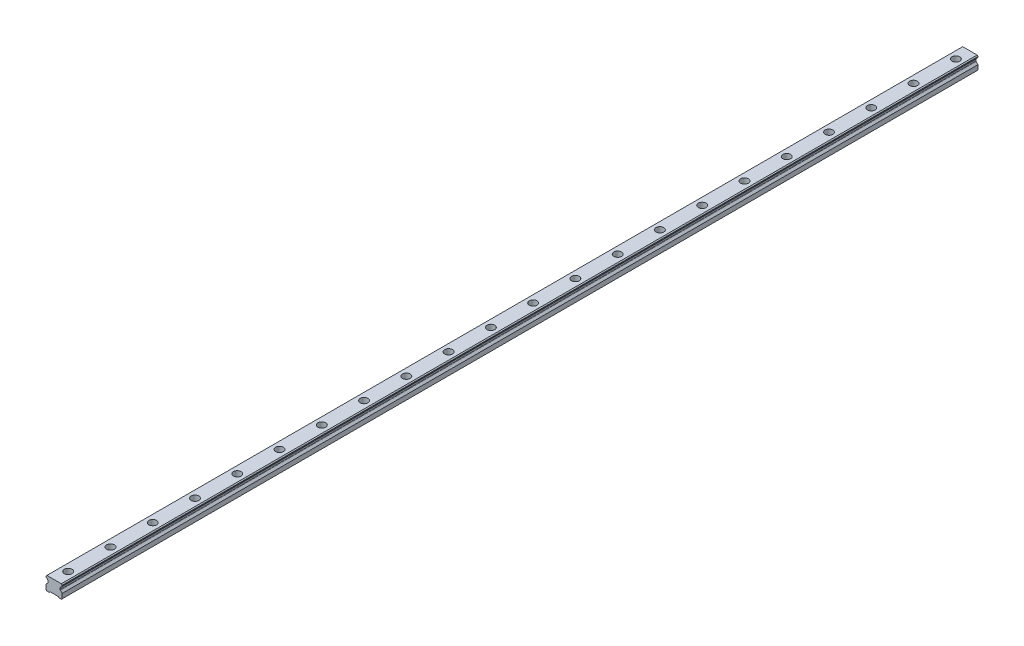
ISO-10303-21;
HEADER;
FILE_DESCRIPTION(('STEP AP214'),'2;1');
FILE_NAME('part.step','',(''),(''),'','','');
FILE_SCHEMA(('AUTOMOTIVE_DESIGN { 1 0 10303 214 1 1 1 1 }'));
ENDSEC;
DATA;
#1=APPLICATION_CONTEXT('core data for automotive mechanical design processes');
#2=APPLICATION_PROTOCOL_DEFINITION('international standard','automotive_design',2000,#1);
#3=PRODUCT_CONTEXT('',#1,'mechanical');
#4=PRODUCT('Part','Part','',(#3));
#5=PRODUCT_RELATED_PRODUCT_CATEGORY('part','',(#4));
#6=PRODUCT_DEFINITION_FORMATION('','',#4);
#7=PRODUCT_DEFINITION_CONTEXT('part definition',#1,'design');
#8=PRODUCT_DEFINITION('design','',#6,#7);
#9=PRODUCT_DEFINITION_SHAPE('','',#8);
#10=(LENGTH_UNIT() NAMED_UNIT(*) SI_UNIT(.MILLI.,.METRE.));
#11=(NAMED_UNIT(*) PLANE_ANGLE_UNIT() SI_UNIT($,.RADIAN.));
#12=(NAMED_UNIT(*) SI_UNIT($,.STERADIAN.) SOLID_ANGLE_UNIT());
#13=UNCERTAINTY_MEASURE_WITH_UNIT(LENGTH_MEASURE(1.E-05),#10,'distance_accuracy_value','');
#14=(GEOMETRIC_REPRESENTATION_CONTEXT(3) GLOBAL_UNCERTAINTY_ASSIGNED_CONTEXT((#13)) GLOBAL_UNIT_ASSIGNED_CONTEXT((#10,
#11,#12)) REPRESENTATION_CONTEXT('',''));
#15=CARTESIAN_POINT('',(0.,0.,0.));
#16=DIRECTION('',(0.,0.,1.));
#17=DIRECTION('',(1.,0.,0.));
#18=AXIS2_PLACEMENT_3D('',#15,#16,#17);
#19=CARTESIAN_POINT('',(0.,10.2,-630.));
#20=DIRECTION('',(0.,1.,0.));
#21=DIRECTION('',(0.,0.,1.));
#22=AXIS2_PLACEMENT_3D('',#19,#20,#21);
#23=PLANE('',#22);
#24=CARTESIAN_POINT('',(0.,10.2,-630.));
#25=DIRECTION('',(0.,1.,0.));
#26=DIRECTION('',(0.,0.,1.));
#27=AXIS2_PLACEMENT_3D('',#24,#25,#26);
#28=CIRCLE('',#27,3.5);
#29=CARTESIAN_POINT('',(0.,10.2,-626.5));
#30=VERTEX_POINT('',#29);
#31=EDGE_CURVE('E518',#30,#30,#28,.T.);
#32=ORIENTED_EDGE('',*,*,#31,.F.);
#33=EDGE_LOOP('',(#32));
#34=FACE_BOUND('',#33,.T.);
#35=CARTESIAN_POINT('',(0.,10.2,-630.));
#36=DIRECTION('',(0.,1.,0.));
#37=DIRECTION('',(0.,0.,1.));
#38=AXIS2_PLACEMENT_3D('',#35,#36,#37);
#39=CIRCLE('',#38,5.5);
#40=CARTESIAN_POINT('',(0.,10.2,-624.5));
#41=VERTEX_POINT('',#40);
#42=EDGE_CURVE('E11',#41,#41,#39,.T.);
#43=ORIENTED_EDGE('',*,*,#42,.T.);
#44=EDGE_LOOP('',(#43));
#45=FACE_BOUND('',#44,.T.);
#46=ADVANCED_FACE('F39',(#34,#45),#23,.T.);
#47=CARTESIAN_POINT('',(0.,10.2,-630.));
#48=DIRECTION('',(0.,1.,0.));
#49=DIRECTION('',(0.,0.,1.));
#50=AXIS2_PLACEMENT_3D('',#47,#48,#49);
#51=CYLINDRICAL_SURFACE('',#50,5.5);
#52=ORIENTED_EDGE('',*,*,#42,.F.);
#53=EDGE_LOOP('',(#52));
#54=FACE_BOUND('',#53,.T.);
#55=CARTESIAN_POINT('',(0.,19.2,-630.));
#56=DIRECTION('',(0.,1.,0.));
#57=DIRECTION('',(0.,0.,1.));
#58=AXIS2_PLACEMENT_3D('',#55,#56,#57);
#59=CIRCLE('',#58,5.5);
#60=CARTESIAN_POINT('',(0.,19.2,-624.5));
#61=VERTEX_POINT('',#60);
#62=EDGE_CURVE('E48',#61,#61,#59,.T.);
#63=ORIENTED_EDGE('',*,*,#62,.T.);
#64=EDGE_LOOP('',(#63));
#65=FACE_BOUND('',#64,.T.);
#66=ADVANCED_FACE('F874',(#54,#65),#51,.F.);
#67=CARTESIAN_POINT('',(0.,10.2,-570.));
#68=DIRECTION('',(0.,1.,0.));
#69=DIRECTION('',(0.,0.,1.));
#70=AXIS2_PLACEMENT_3D('',#67,#68,#69);
#71=PLANE('',#70);
#72=CARTESIAN_POINT('',(0.,10.2,-570.));
#73=DIRECTION('',(0.,1.,0.));
#74=DIRECTION('',(0.,0.,1.));
#75=AXIS2_PLACEMENT_3D('',#72,#73,#74);
#76=CIRCLE('',#75,3.5);
#77=CARTESIAN_POINT('',(0.,10.2,-566.5));
#78=VERTEX_POINT('',#77);
#79=EDGE_CURVE('E523',#78,#78,#76,.T.);
#80=ORIENTED_EDGE('',*,*,#79,.F.);
#81=EDGE_LOOP('',(#80));
#82=FACE_BOUND('',#81,.T.);
#83=CARTESIAN_POINT('',(0.,10.2,-570.));
#84=DIRECTION('',(0.,1.,0.));
#85=DIRECTION('',(0.,0.,1.));
#86=AXIS2_PLACEMENT_3D('',#83,#84,#85);
#87=CIRCLE('',#86,5.5);
#88=CARTESIAN_POINT('',(0.,10.2,-564.5));
#89=VERTEX_POINT('',#88);
#90=EDGE_CURVE('E502',#89,#89,#87,.T.);
#91=ORIENTED_EDGE('',*,*,#90,.T.);
#92=EDGE_LOOP('',(#91));
#93=FACE_BOUND('',#92,.T.);
#94=ADVANCED_FACE('F876',(#82,#93),#71,.T.);
#95=CARTESIAN_POINT('',(0.,10.2,-570.));
#96=DIRECTION('',(0.,1.,0.));
#97=DIRECTION('',(0.,0.,1.));
#98=AXIS2_PLACEMENT_3D('',#95,#96,#97);
#99=CYLINDRICAL_SURFACE('',#98,5.5);
#100=ORIENTED_EDGE('',*,*,#90,.F.);
#101=EDGE_LOOP('',(#100));
#102=FACE_BOUND('',#101,.T.);
#103=CARTESIAN_POINT('',(0.,19.2,-570.));
#104=DIRECTION('',(0.,1.,0.));
#105=DIRECTION('',(0.,0.,1.));
#106=AXIS2_PLACEMENT_3D('',#103,#104,#105);
#107=CIRCLE('',#106,5.5);
#108=CARTESIAN_POINT('',(0.,19.2,-564.5));
#109=VERTEX_POINT('',#108);
#110=EDGE_CURVE('E498',#109,#109,#107,.T.);
#111=ORIENTED_EDGE('',*,*,#110,.T.);
#112=EDGE_LOOP('',(#111));
#113=FACE_BOUND('',#112,.T.);
#114=ADVANCED_FACE('F882',(#102,#113),#99,.F.);
#115=CARTESIAN_POINT('',(0.,10.2,-510.));
#116=DIRECTION('',(0.,1.,0.));
#117=DIRECTION('',(0.,0.,1.));
#118=AXIS2_PLACEMENT_3D('',#115,#116,#117);
#119=PLANE('',#118);
#120=CARTESIAN_POINT('',(0.,10.2,-510.));
#121=DIRECTION('',(0.,1.,0.));
#122=DIRECTION('',(0.,0.,1.));
#123=AXIS2_PLACEMENT_3D('',#120,#121,#122);
#124=CIRCLE('',#123,3.5);
#125=CARTESIAN_POINT('',(0.,10.2,-506.5));
#126=VERTEX_POINT('',#125);
#127=EDGE_CURVE('E528',#126,#126,#124,.T.);
#128=ORIENTED_EDGE('',*,*,#127,.F.);
#129=EDGE_LOOP('',(#128));
#130=FACE_BOUND('',#129,.T.);
#131=CARTESIAN_POINT('',(0.,10.2,-510.));
#132=DIRECTION('',(0.,1.,0.));
#133=DIRECTION('',(0.,0.,1.));
#134=AXIS2_PLACEMENT_3D('',#131,#132,#133);
#135=CIRCLE('',#134,5.5);
#136=CARTESIAN_POINT('',(0.,10.2,-504.5));
#137=VERTEX_POINT('',#136);
#138=EDGE_CURVE('E494',#137,#137,#135,.T.);
#139=ORIENTED_EDGE('',*,*,#138,.T.);
#140=EDGE_LOOP('',(#139));
#141=FACE_BOUND('',#140,.T.);
#142=ADVANCED_FACE('F890',(#130,#141),#119,.T.);
#143=CARTESIAN_POINT('',(0.,10.2,-510.));
#144=DIRECTION('',(0.,1.,0.));
#145=DIRECTION('',(0.,0.,1.));
#146=AXIS2_PLACEMENT_3D('',#143,#144,#145);
#147=CYLINDRICAL_SURFACE('',#146,5.5);
#148=ORIENTED_EDGE('',*,*,#138,.F.);
#149=EDGE_LOOP('',(#148));
#150=FACE_BOUND('',#149,.T.);
#151=CARTESIAN_POINT('',(0.,19.2,-510.));
#152=DIRECTION('',(0.,1.,0.));
#153=DIRECTION('',(0.,0.,1.));
#154=AXIS2_PLACEMENT_3D('',#151,#152,#153);
#155=CIRCLE('',#154,5.5);
#156=CARTESIAN_POINT('',(0.,19.2,-504.5));
#157=VERTEX_POINT('',#156);
#158=EDGE_CURVE('E490',#157,#157,#155,.T.);
#159=ORIENTED_EDGE('',*,*,#158,.T.);
#160=EDGE_LOOP('',(#159));
#161=FACE_BOUND('',#160,.T.);
#162=ADVANCED_FACE('F894',(#150,#161),#147,.F.);
#163=CARTESIAN_POINT('',(0.,10.2,-450.));
#164=DIRECTION('',(0.,1.,0.));
#165=DIRECTION('',(0.,0.,1.));
#166=AXIS2_PLACEMENT_3D('',#163,#164,#165);
#167=PLANE('',#166);
#168=CARTESIAN_POINT('',(0.,10.2,-450.));
#169=DIRECTION('',(0.,1.,0.));
#170=DIRECTION('',(0.,0.,1.));
#171=AXIS2_PLACEMENT_3D('',#168,#169,#170);
#172=CIRCLE('',#171,3.5);
#173=CARTESIAN_POINT('',(0.,10.2,-446.5));
#174=VERTEX_POINT('',#173);
#175=EDGE_CURVE('E533',#174,#174,#172,.T.);
#176=ORIENTED_EDGE('',*,*,#175,.F.);
#177=EDGE_LOOP('',(#176));
#178=FACE_BOUND('',#177,.T.);
#179=CARTESIAN_POINT('',(0.,10.2,-450.));
#180=DIRECTION('',(0.,1.,0.));
#181=DIRECTION('',(0.,0.,1.));
#182=AXIS2_PLACEMENT_3D('',#179,#180,#181);
#183=CIRCLE('',#182,5.5);
#184=CARTESIAN_POINT('',(0.,10.2,-444.5));
#185=VERTEX_POINT('',#184);
#186=EDGE_CURVE('E486',#185,#185,#183,.T.);
#187=ORIENTED_EDGE('',*,*,#186,.T.);
#188=EDGE_LOOP('',(#187));
#189=FACE_BOUND('',#188,.T.);
#190=ADVANCED_FACE('F898',(#178,#189),#167,.T.);
#191=CARTESIAN_POINT('',(0.,10.2,-450.));
#192=DIRECTION('',(0.,1.,0.));
#193=DIRECTION('',(0.,0.,1.));
#194=AXIS2_PLACEMENT_3D('',#191,#192,#193);
#195=CYLINDRICAL_SURFACE('',#194,5.5);
#196=ORIENTED_EDGE('',*,*,#186,.F.);
#197=EDGE_LOOP('',(#196));
#198=FACE_BOUND('',#197,.T.);
#199=CARTESIAN_POINT('',(0.,19.2,-450.));
#200=DIRECTION('',(0.,1.,0.));
#201=DIRECTION('',(0.,0.,1.));
#202=AXIS2_PLACEMENT_3D('',#199,#200,#201);
#203=CIRCLE('',#202,5.5);
#204=CARTESIAN_POINT('',(0.,19.2,-444.5));
#205=VERTEX_POINT('',#204);
#206=EDGE_CURVE('E482',#205,#205,#203,.T.);
#207=ORIENTED_EDGE('',*,*,#206,.T.);
#208=EDGE_LOOP('',(#207));
#209=FACE_BOUND('',#208,.T.);
#210=ADVANCED_FACE('F902',(#198,#209),#195,.F.);
#211=CARTESIAN_POINT('',(0.,10.2,-390.));
#212=DIRECTION('',(0.,1.,0.));
#213=DIRECTION('',(0.,0.,1.));
#214=AXIS2_PLACEMENT_3D('',#211,#212,#213);
#215=PLANE('',#214);
#216=CARTESIAN_POINT('',(0.,10.2,-390.));
#217=DIRECTION('',(0.,1.,0.));
#218=DIRECTION('',(0.,0.,1.));
#219=AXIS2_PLACEMENT_3D('',#216,#217,#218);
#220=CIRCLE('',#219,3.5);
#221=CARTESIAN_POINT('',(0.,10.2,-386.5));
#222=VERTEX_POINT('',#221);
#223=EDGE_CURVE('E538',#222,#222,#220,.T.);
#224=ORIENTED_EDGE('',*,*,#223,.F.);
#225=EDGE_LOOP('',(#224));
#226=FACE_BOUND('',#225,.T.);
#227=CARTESIAN_POINT('',(0.,10.2,-390.));
#228=DIRECTION('',(0.,1.,0.));
#229=DIRECTION('',(0.,0.,1.));
#230=AXIS2_PLACEMENT_3D('',#227,#228,#229);
#231=CIRCLE('',#230,5.5);
#232=CARTESIAN_POINT('',(0.,10.2,-384.5));
#233=VERTEX_POINT('',#232);
#234=EDGE_CURVE('E478',#233,#233,#231,.T.);
#235=ORIENTED_EDGE('',*,*,#234,.T.);
#236=EDGE_LOOP('',(#235));
#237=FACE_BOUND('',#236,.T.);
#238=ADVANCED_FACE('F906',(#226,#237),#215,.T.);
#239=CARTESIAN_POINT('',(0.,10.2,-390.));
#240=DIRECTION('',(0.,1.,0.));
#241=DIRECTION('',(0.,0.,1.));
#242=AXIS2_PLACEMENT_3D('',#239,#240,#241);
#243=CYLINDRICAL_SURFACE('',#242,5.5);
#244=ORIENTED_EDGE('',*,*,#234,.F.);
#245=EDGE_LOOP('',(#244));
#246=FACE_BOUND('',#245,.T.);
#247=CARTESIAN_POINT('',(0.,19.2,-390.));
#248=DIRECTION('',(0.,1.,0.));
#249=DIRECTION('',(0.,0.,1.));
#250=AXIS2_PLACEMENT_3D('',#247,#248,#249);
#251=CIRCLE('',#250,5.5);
#252=CARTESIAN_POINT('',(0.,19.2,-384.5));
#253=VERTEX_POINT('',#252);
#254=EDGE_CURVE('E474',#253,#253,#251,.T.);
#255=ORIENTED_EDGE('',*,*,#254,.T.);
#256=EDGE_LOOP('',(#255));
#257=FACE_BOUND('',#256,.T.);
#258=ADVANCED_FACE('F910',(#246,#257),#243,.F.);
#259=CARTESIAN_POINT('',(0.,10.2,-330.));
#260=DIRECTION('',(0.,1.,0.));
#261=DIRECTION('',(0.,0.,1.));
#262=AXIS2_PLACEMENT_3D('',#259,#260,#261);
#263=PLANE('',#262);
#264=CARTESIAN_POINT('',(0.,10.2,-330.));
#265=DIRECTION('',(0.,1.,0.));
#266=DIRECTION('',(0.,0.,1.));
#267=AXIS2_PLACEMENT_3D('',#264,#265,#266);
#268=CIRCLE('',#267,3.5);
#269=CARTESIAN_POINT('',(0.,10.2,-326.5));
#270=VERTEX_POINT('',#269);
#271=EDGE_CURVE('E543',#270,#270,#268,.T.);
#272=ORIENTED_EDGE('',*,*,#271,.F.);
#273=EDGE_LOOP('',(#272));
#274=FACE_BOUND('',#273,.T.);
#275=CARTESIAN_POINT('',(0.,10.2,-330.));
#276=DIRECTION('',(0.,1.,0.));
#277=DIRECTION('',(0.,0.,1.));
#278=AXIS2_PLACEMENT_3D('',#275,#276,#277);
#279=CIRCLE('',#278,5.5);
#280=CARTESIAN_POINT('',(0.,10.2,-324.5));
#281=VERTEX_POINT('',#280);
#282=EDGE_CURVE('E470',#281,#281,#279,.T.);
#283=ORIENTED_EDGE('',*,*,#282,.T.);
#284=EDGE_LOOP('',(#283));
#285=FACE_BOUND('',#284,.T.);
#286=ADVANCED_FACE('F914',(#274,#285),#263,.T.);
#287=CARTESIAN_POINT('',(0.,10.2,-330.));
#288=DIRECTION('',(0.,1.,0.));
#289=DIRECTION('',(0.,0.,1.));
#290=AXIS2_PLACEMENT_3D('',#287,#288,#289);
#291=CYLINDRICAL_SURFACE('',#290,5.5);
#292=ORIENTED_EDGE('',*,*,#282,.F.);
#293=EDGE_LOOP('',(#292));
#294=FACE_BOUND('',#293,.T.);
#295=CARTESIAN_POINT('',(0.,19.2,-330.));
#296=DIRECTION('',(0.,1.,0.));
#297=DIRECTION('',(0.,0.,1.));
#298=AXIS2_PLACEMENT_3D('',#295,#296,#297);
#299=CIRCLE('',#298,5.5);
#300=CARTESIAN_POINT('',(0.,19.2,-324.5));
#301=VERTEX_POINT('',#300);
#302=EDGE_CURVE('E466',#301,#301,#299,.T.);
#303=ORIENTED_EDGE('',*,*,#302,.T.);
#304=EDGE_LOOP('',(#303));
#305=FACE_BOUND('',#304,.T.);
#306=ADVANCED_FACE('F918',(#294,#305),#291,.F.);
#307=CARTESIAN_POINT('',(0.,10.2,-270.));
#308=DIRECTION('',(0.,1.,0.));
#309=DIRECTION('',(0.,0.,1.));
#310=AXIS2_PLACEMENT_3D('',#307,#308,#309);
#311=PLANE('',#310);
#312=CARTESIAN_POINT('',(0.,10.2,-270.));
#313=DIRECTION('',(0.,1.,0.));
#314=DIRECTION('',(0.,0.,1.));
#315=AXIS2_PLACEMENT_3D('',#312,#313,#314);
#316=CIRCLE('',#315,3.5);
#317=CARTESIAN_POINT('',(0.,10.2,-266.5));
#318=VERTEX_POINT('',#317);
#319=EDGE_CURVE('E548',#318,#318,#316,.T.);
#320=ORIENTED_EDGE('',*,*,#319,.F.);
#321=EDGE_LOOP('',(#320));
#322=FACE_BOUND('',#321,.T.);
#323=CARTESIAN_POINT('',(0.,10.2,-270.));
#324=DIRECTION('',(0.,1.,0.));
#325=DIRECTION('',(0.,0.,1.));
#326=AXIS2_PLACEMENT_3D('',#323,#324,#325);
#327=CIRCLE('',#326,5.5);
#328=CARTESIAN_POINT('',(0.,10.2,-264.5));
#329=VERTEX_POINT('',#328);
#330=EDGE_CURVE('E462',#329,#329,#327,.T.);
#331=ORIENTED_EDGE('',*,*,#330,.T.);
#332=EDGE_LOOP('',(#331));
#333=FACE_BOUND('',#332,.T.);
#334=ADVANCED_FACE('F922',(#322,#333),#311,.T.);
#335=CARTESIAN_POINT('',(0.,10.2,-270.));
#336=DIRECTION('',(0.,1.,0.));
#337=DIRECTION('',(0.,0.,1.));
#338=AXIS2_PLACEMENT_3D('',#335,#336,#337);
#339=CYLINDRICAL_SURFACE('',#338,5.5);
#340=ORIENTED_EDGE('',*,*,#330,.F.);
#341=EDGE_LOOP('',(#340));
#342=FACE_BOUND('',#341,.T.);
#343=CARTESIAN_POINT('',(0.,19.2,-270.));
#344=DIRECTION('',(0.,1.,0.));
#345=DIRECTION('',(0.,0.,1.));
#346=AXIS2_PLACEMENT_3D('',#343,#344,#345);
#347=CIRCLE('',#346,5.5);
#348=CARTESIAN_POINT('',(0.,19.2,-264.5));
#349=VERTEX_POINT('',#348);
#350=EDGE_CURVE('E458',#349,#349,#347,.T.);
#351=ORIENTED_EDGE('',*,*,#350,.T.);
#352=EDGE_LOOP('',(#351));
#353=FACE_BOUND('',#352,.T.);
#354=ADVANCED_FACE('F926',(#342,#353),#339,.F.);
#355=CARTESIAN_POINT('',(0.,10.2,-210.));
#356=DIRECTION('',(0.,1.,0.));
#357=DIRECTION('',(0.,0.,1.));
#358=AXIS2_PLACEMENT_3D('',#355,#356,#357);
#359=PLANE('',#358);
#360=CARTESIAN_POINT('',(0.,10.2,-210.));
#361=DIRECTION('',(0.,1.,0.));
#362=DIRECTION('',(0.,0.,1.));
#363=AXIS2_PLACEMENT_3D('',#360,#361,#362);
#364=CIRCLE('',#363,3.5);
#365=CARTESIAN_POINT('',(0.,10.2,-206.5));
#366=VERTEX_POINT('',#365);
#367=EDGE_CURVE('E553',#366,#366,#364,.T.);
#368=ORIENTED_EDGE('',*,*,#367,.F.);
#369=EDGE_LOOP('',(#368));
#370=FACE_BOUND('',#369,.T.);
#371=CARTESIAN_POINT('',(0.,10.2,-210.));
#372=DIRECTION('',(0.,1.,0.));
#373=DIRECTION('',(0.,0.,1.));
#374=AXIS2_PLACEMENT_3D('',#371,#372,#373);
#375=CIRCLE('',#374,5.5);
#376=CARTESIAN_POINT('',(0.,10.2,-204.5));
#377=VERTEX_POINT('',#376);
#378=EDGE_CURVE('E454',#377,#377,#375,.T.);
#379=ORIENTED_EDGE('',*,*,#378,.T.);
#380=EDGE_LOOP('',(#379));
#381=FACE_BOUND('',#380,.T.);
#382=ADVANCED_FACE('F930',(#370,#381),#359,.T.);
#383=CARTESIAN_POINT('',(0.,10.2,-210.));
#384=DIRECTION('',(0.,1.,0.));
#385=DIRECTION('',(0.,0.,1.));
#386=AXIS2_PLACEMENT_3D('',#383,#384,#385);
#387=CYLINDRICAL_SURFACE('',#386,5.5);
#388=ORIENTED_EDGE('',*,*,#378,.F.);
#389=EDGE_LOOP('',(#388));
#390=FACE_BOUND('',#389,.T.);
#391=CARTESIAN_POINT('',(0.,19.2,-210.));
#392=DIRECTION('',(0.,1.,0.));
#393=DIRECTION('',(0.,0.,1.));
#394=AXIS2_PLACEMENT_3D('',#391,#392,#393);
#395=CIRCLE('',#394,5.5);
#396=CARTESIAN_POINT('',(0.,19.2,-204.5));
#397=VERTEX_POINT('',#396);
#398=EDGE_CURVE('E450',#397,#397,#395,.T.);
#399=ORIENTED_EDGE('',*,*,#398,.T.);
#400=EDGE_LOOP('',(#399));
#401=FACE_BOUND('',#400,.T.);
#402=ADVANCED_FACE('F934',(#390,#401),#387,.F.);
#403=CARTESIAN_POINT('',(0.,10.2,-150.));
#404=DIRECTION('',(0.,1.,0.));
#405=DIRECTION('',(0.,0.,1.));
#406=AXIS2_PLACEMENT_3D('',#403,#404,#405);
#407=PLANE('',#406);
#408=CARTESIAN_POINT('',(0.,10.2,-150.));
#409=DIRECTION('',(0.,1.,0.));
#410=DIRECTION('',(0.,0.,1.));
#411=AXIS2_PLACEMENT_3D('',#408,#409,#410);
#412=CIRCLE('',#411,3.5);
#413=CARTESIAN_POINT('',(0.,10.2,-146.5));
#414=VERTEX_POINT('',#413);
#415=EDGE_CURVE('E558',#414,#414,#412,.T.);
#416=ORIENTED_EDGE('',*,*,#415,.F.);
#417=EDGE_LOOP('',(#416));
#418=FACE_BOUND('',#417,.T.);
#419=CARTESIAN_POINT('',(0.,10.2,-150.));
#420=DIRECTION('',(0.,1.,0.));
#421=DIRECTION('',(0.,0.,1.));
#422=AXIS2_PLACEMENT_3D('',#419,#420,#421);
#423=CIRCLE('',#422,5.5);
#424=CARTESIAN_POINT('',(0.,10.2,-144.5));
#425=VERTEX_POINT('',#424);
#426=EDGE_CURVE('E446',#425,#425,#423,.T.);
#427=ORIENTED_EDGE('',*,*,#426,.T.);
#428=EDGE_LOOP('',(#427));
#429=FACE_BOUND('',#428,.T.);
#430=ADVANCED_FACE('F938',(#418,#429),#407,.T.);
#431=CARTESIAN_POINT('',(0.,10.2,-150.));
#432=DIRECTION('',(0.,1.,0.));
#433=DIRECTION('',(0.,0.,1.));
#434=AXIS2_PLACEMENT_3D('',#431,#432,#433);
#435=CYLINDRICAL_SURFACE('',#434,5.5);
#436=ORIENTED_EDGE('',*,*,#426,.F.);
#437=EDGE_LOOP('',(#436));
#438=FACE_BOUND('',#437,.T.);
#439=CARTESIAN_POINT('',(0.,19.2,-150.));
#440=DIRECTION('',(0.,1.,0.));
#441=DIRECTION('',(0.,0.,1.));
#442=AXIS2_PLACEMENT_3D('',#439,#440,#441);
#443=CIRCLE('',#442,5.5);
#444=CARTESIAN_POINT('',(0.,19.2,-144.5));
#445=VERTEX_POINT('',#444);
#446=EDGE_CURVE('E442',#445,#445,#443,.T.);
#447=ORIENTED_EDGE('',*,*,#446,.T.);
#448=EDGE_LOOP('',(#447));
#449=FACE_BOUND('',#448,.T.);
#450=ADVANCED_FACE('F942',(#438,#449),#435,.F.);
#451=CARTESIAN_POINT('',(0.,10.2,-89.9999999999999));
#452=DIRECTION('',(0.,1.,0.));
#453=DIRECTION('',(0.,0.,1.));
#454=AXIS2_PLACEMENT_3D('',#451,#452,#453);
#455=PLANE('',#454);
#456=CARTESIAN_POINT('',(0.,10.2,-90.));
#457=DIRECTION('',(0.,1.,0.));
#458=DIRECTION('',(0.,0.,1.));
#459=AXIS2_PLACEMENT_3D('',#456,#457,#458);
#460=CIRCLE('',#459,3.5);
#461=CARTESIAN_POINT('',(0.,10.2,-86.5));
#462=VERTEX_POINT('',#461);
#463=EDGE_CURVE('E563',#462,#462,#460,.T.);
#464=ORIENTED_EDGE('',*,*,#463,.F.);
#465=EDGE_LOOP('',(#464));
#466=FACE_BOUND('',#465,.T.);
#467=CARTESIAN_POINT('',(0.,10.2,-89.9999999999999));
#468=DIRECTION('',(0.,1.,0.));
#469=DIRECTION('',(0.,0.,1.));
#470=AXIS2_PLACEMENT_3D('',#467,#468,#469);
#471=CIRCLE('',#470,5.5);
#472=CARTESIAN_POINT('',(0.,10.2,-84.4999999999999));
#473=VERTEX_POINT('',#472);
#474=EDGE_CURVE('E438',#473,#473,#471,.T.);
#475=ORIENTED_EDGE('',*,*,#474,.T.);
#476=EDGE_LOOP('',(#475));
#477=FACE_BOUND('',#476,.T.);
#478=ADVANCED_FACE('F946',(#466,#477),#455,.T.);
#479=CARTESIAN_POINT('',(0.,10.2,-89.9999999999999));
#480=DIRECTION('',(0.,1.,0.));
#481=DIRECTION('',(0.,0.,1.));
#482=AXIS2_PLACEMENT_3D('',#479,#480,#481);
#483=CYLINDRICAL_SURFACE('',#482,5.5);
#484=ORIENTED_EDGE('',*,*,#474,.F.);
#485=EDGE_LOOP('',(#484));
#486=FACE_BOUND('',#485,.T.);
#487=CARTESIAN_POINT('',(0.,19.2,-89.9999999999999));
#488=DIRECTION('',(0.,1.,0.));
#489=DIRECTION('',(0.,0.,1.));
#490=AXIS2_PLACEMENT_3D('',#487,#488,#489);
#491=CIRCLE('',#490,5.5);
#492=CARTESIAN_POINT('',(0.,19.2,-84.4999999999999));
#493=VERTEX_POINT('',#492);
#494=EDGE_CURVE('E434',#493,#493,#491,.T.);
#495=ORIENTED_EDGE('',*,*,#494,.T.);
#496=EDGE_LOOP('',(#495));
#497=FACE_BOUND('',#496,.T.);
#498=ADVANCED_FACE('F950',(#486,#497),#483,.F.);
#499=CARTESIAN_POINT('',(0.,10.2,-29.9999999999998));
#500=DIRECTION('',(0.,1.,0.));
#501=DIRECTION('',(0.,0.,1.));
#502=AXIS2_PLACEMENT_3D('',#499,#500,#501);
#503=PLANE('',#502);
#504=CARTESIAN_POINT('',(0.,10.2,-29.9999999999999));
#505=DIRECTION('',(0.,1.,0.));
#506=DIRECTION('',(0.,0.,1.));
#507=AXIS2_PLACEMENT_3D('',#504,#505,#506);
#508=CIRCLE('',#507,3.5);
#509=CARTESIAN_POINT('',(0.,10.2,-26.4999999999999));
#510=VERTEX_POINT('',#509);
#511=EDGE_CURVE('E568',#510,#510,#508,.T.);
#512=ORIENTED_EDGE('',*,*,#511,.F.);
#513=EDGE_LOOP('',(#512));
#514=FACE_BOUND('',#513,.T.);
#515=CARTESIAN_POINT('',(0.,10.2,-29.9999999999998));
#516=DIRECTION('',(0.,1.,0.));
#517=DIRECTION('',(0.,0.,1.));
#518=AXIS2_PLACEMENT_3D('',#515,#516,#517);
#519=CIRCLE('',#518,5.5);
#520=CARTESIAN_POINT('',(0.,10.2,-24.4999999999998));
#521=VERTEX_POINT('',#520);
#522=EDGE_CURVE('E430',#521,#521,#519,.T.);
#523=ORIENTED_EDGE('',*,*,#522,.T.);
#524=EDGE_LOOP('',(#523));
#525=FACE_BOUND('',#524,.T.);
#526=ADVANCED_FACE('F954',(#514,#525),#503,.T.);
#527=CARTESIAN_POINT('',(0.,10.2,-29.9999999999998));
#528=DIRECTION('',(0.,1.,0.));
#529=DIRECTION('',(0.,0.,1.));
#530=AXIS2_PLACEMENT_3D('',#527,#528,#529);
#531=CYLINDRICAL_SURFACE('',#530,5.5);
#532=ORIENTED_EDGE('',*,*,#522,.F.);
#533=EDGE_LOOP('',(#532));
#534=FACE_BOUND('',#533,.T.);
#535=CARTESIAN_POINT('',(0.,19.2,-29.9999999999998));
#536=DIRECTION('',(0.,1.,0.));
#537=DIRECTION('',(0.,0.,1.));
#538=AXIS2_PLACEMENT_3D('',#535,#536,#537);
#539=CIRCLE('',#538,5.5);
#540=CARTESIAN_POINT('',(0.,19.2,-24.4999999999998));
#541=VERTEX_POINT('',#540);
#542=EDGE_CURVE('E426',#541,#541,#539,.T.);
#543=ORIENTED_EDGE('',*,*,#542,.T.);
#544=EDGE_LOOP('',(#543));
#545=FACE_BOUND('',#544,.T.);
#546=ADVANCED_FACE('F958',(#534,#545),#531,.F.);
#547=CARTESIAN_POINT('',(0.,10.2,30.));
#548=DIRECTION('',(0.,1.,0.));
#549=DIRECTION('',(0.,0.,1.));
#550=AXIS2_PLACEMENT_3D('',#547,#548,#549);
#551=PLANE('',#550);
#552=CARTESIAN_POINT('',(0.,10.2,30.));
#553=DIRECTION('',(0.,1.,0.));
#554=DIRECTION('',(0.,0.,1.));
#555=AXIS2_PLACEMENT_3D('',#552,#553,#554);
#556=CIRCLE('',#555,3.5);
#557=CARTESIAN_POINT('',(0.,10.2,33.5));
#558=VERTEX_POINT('',#557);
#559=EDGE_CURVE('E573',#558,#558,#556,.T.);
#560=ORIENTED_EDGE('',*,*,#559,.F.);
#561=EDGE_LOOP('',(#560));
#562=FACE_BOUND('',#561,.T.);
#563=CARTESIAN_POINT('',(0.,10.2,30.));
#564=DIRECTION('',(0.,1.,0.));
#565=DIRECTION('',(0.,0.,1.));
#566=AXIS2_PLACEMENT_3D('',#563,#564,#565);
#567=CIRCLE('',#566,5.5);
#568=CARTESIAN_POINT('',(0.,10.2,35.5));
#569=VERTEX_POINT('',#568);
#570=EDGE_CURVE('E422',#569,#569,#567,.T.);
#571=ORIENTED_EDGE('',*,*,#570,.T.);
#572=EDGE_LOOP('',(#571));
#573=FACE_BOUND('',#572,.T.);
#574=ADVANCED_FACE('F962',(#562,#573),#551,.T.);
#575=CARTESIAN_POINT('',(0.,10.2,30.));
#576=DIRECTION('',(0.,1.,0.));
#577=DIRECTION('',(0.,0.,1.));
#578=AXIS2_PLACEMENT_3D('',#575,#576,#577);
#579=CYLINDRICAL_SURFACE('',#578,5.5);
#580=ORIENTED_EDGE('',*,*,#570,.F.);
#581=EDGE_LOOP('',(#580));
#582=FACE_BOUND('',#581,.T.);
#583=CARTESIAN_POINT('',(0.,19.2,30.));
#584=DIRECTION('',(0.,1.,0.));
#585=DIRECTION('',(0.,0.,1.));
#586=AXIS2_PLACEMENT_3D('',#583,#584,#585);
#587=CIRCLE('',#586,5.5);
#588=CARTESIAN_POINT('',(0.,19.2,35.5));
#589=VERTEX_POINT('',#588);
#590=EDGE_CURVE('E418',#589,#589,#587,.T.);
#591=ORIENTED_EDGE('',*,*,#590,.T.);
#592=EDGE_LOOP('',(#591));
#593=FACE_BOUND('',#592,.T.);
#594=ADVANCED_FACE('F966',(#582,#593),#579,.F.);
#595=CARTESIAN_POINT('',(0.,10.2,90.));
#596=DIRECTION('',(0.,1.,0.));
#597=DIRECTION('',(0.,0.,1.));
#598=AXIS2_PLACEMENT_3D('',#595,#596,#597);
#599=PLANE('',#598);
#600=CARTESIAN_POINT('',(0.,10.2,90.));
#601=DIRECTION('',(0.,1.,0.));
#602=DIRECTION('',(0.,0.,1.));
#603=AXIS2_PLACEMENT_3D('',#600,#601,#602);
#604=CIRCLE('',#603,3.5);
#605=CARTESIAN_POINT('',(0.,10.2,93.5));
#606=VERTEX_POINT('',#605);
#607=EDGE_CURVE('E578',#606,#606,#604,.T.);
#608=ORIENTED_EDGE('',*,*,#607,.F.);
#609=EDGE_LOOP('',(#608));
#610=FACE_BOUND('',#609,.T.);
#611=CARTESIAN_POINT('',(0.,10.2,90.));
#612=DIRECTION('',(0.,1.,0.));
#613=DIRECTION('',(0.,0.,1.));
#614=AXIS2_PLACEMENT_3D('',#611,#612,#613);
#615=CIRCLE('',#614,5.5);
#616=CARTESIAN_POINT('',(0.,10.2,95.5));
#617=VERTEX_POINT('',#616);
#618=EDGE_CURVE('E414',#617,#617,#615,.T.);
#619=ORIENTED_EDGE('',*,*,#618,.T.);
#620=EDGE_LOOP('',(#619));
#621=FACE_BOUND('',#620,.T.);
#622=ADVANCED_FACE('F970',(#610,#621),#599,.T.);
#623=CARTESIAN_POINT('',(0.,10.2,90.));
#624=DIRECTION('',(0.,1.,0.));
#625=DIRECTION('',(0.,0.,1.));
#626=AXIS2_PLACEMENT_3D('',#623,#624,#625);
#627=CYLINDRICAL_SURFACE('',#626,5.5);
#628=ORIENTED_EDGE('',*,*,#618,.F.);
#629=EDGE_LOOP('',(#628));
#630=FACE_BOUND('',#629,.T.);
#631=CARTESIAN_POINT('',(0.,19.2,90.));
#632=DIRECTION('',(0.,1.,0.));
#633=DIRECTION('',(0.,0.,1.));
#634=AXIS2_PLACEMENT_3D('',#631,#632,#633);
#635=CIRCLE('',#634,5.5);
#636=CARTESIAN_POINT('',(0.,19.2,95.5));
#637=VERTEX_POINT('',#636);
#638=EDGE_CURVE('E410',#637,#637,#635,.T.);
#639=ORIENTED_EDGE('',*,*,#638,.T.);
#640=EDGE_LOOP('',(#639));
#641=FACE_BOUND('',#640,.T.);
#642=ADVANCED_FACE('F974',(#630,#641),#627,.F.);
#643=CARTESIAN_POINT('',(0.,10.2,150.));
#644=DIRECTION('',(0.,1.,0.));
#645=DIRECTION('',(0.,0.,1.));
#646=AXIS2_PLACEMENT_3D('',#643,#644,#645);
#647=PLANE('',#646);
#648=CARTESIAN_POINT('',(0.,10.2,150.));
#649=DIRECTION('',(0.,1.,0.));
#650=DIRECTION('',(0.,0.,1.));
#651=AXIS2_PLACEMENT_3D('',#648,#649,#650);
#652=CIRCLE('',#651,3.5);
#653=CARTESIAN_POINT('',(0.,10.2,153.5));
#654=VERTEX_POINT('',#653);
#655=EDGE_CURVE('E583',#654,#654,#652,.T.);
#656=ORIENTED_EDGE('',*,*,#655,.F.);
#657=EDGE_LOOP('',(#656));
#658=FACE_BOUND('',#657,.T.);
#659=CARTESIAN_POINT('',(0.,10.2,150.));
#660=DIRECTION('',(0.,1.,0.));
#661=DIRECTION('',(0.,0.,1.));
#662=AXIS2_PLACEMENT_3D('',#659,#660,#661);
#663=CIRCLE('',#662,5.5);
#664=CARTESIAN_POINT('',(0.,10.2,155.5));
#665=VERTEX_POINT('',#664);
#666=EDGE_CURVE('E406',#665,#665,#663,.T.);
#667=ORIENTED_EDGE('',*,*,#666,.T.);
#668=EDGE_LOOP('',(#667));
#669=FACE_BOUND('',#668,.T.);
#670=ADVANCED_FACE('F978',(#658,#669),#647,.T.);
#671=CARTESIAN_POINT('',(0.,10.2,150.));
#672=DIRECTION('',(0.,1.,0.));
#673=DIRECTION('',(0.,0.,1.));
#674=AXIS2_PLACEMENT_3D('',#671,#672,#673);
#675=CYLINDRICAL_SURFACE('',#674,5.5);
#676=ORIENTED_EDGE('',*,*,#666,.F.);
#677=EDGE_LOOP('',(#676));
#678=FACE_BOUND('',#677,.T.);
#679=CARTESIAN_POINT('',(0.,19.2,150.));
#680=DIRECTION('',(0.,1.,0.));
#681=DIRECTION('',(0.,0.,1.));
#682=AXIS2_PLACEMENT_3D('',#679,#680,#681);
#683=CIRCLE('',#682,5.5);
#684=CARTESIAN_POINT('',(0.,19.2,155.5));
#685=VERTEX_POINT('',#684);
#686=EDGE_CURVE('E402',#685,#685,#683,.T.);
#687=ORIENTED_EDGE('',*,*,#686,.T.);
#688=EDGE_LOOP('',(#687));
#689=FACE_BOUND('',#688,.T.);
#690=ADVANCED_FACE('F982',(#678,#689),#675,.F.);
#691=CARTESIAN_POINT('',(0.,10.2,210.));
#692=DIRECTION('',(0.,1.,0.));
#693=DIRECTION('',(0.,0.,1.));
#694=AXIS2_PLACEMENT_3D('',#691,#692,#693);
#695=PLANE('',#694);
#696=CARTESIAN_POINT('',(0.,10.2,210.));
#697=DIRECTION('',(0.,1.,0.));
#698=DIRECTION('',(0.,0.,1.));
#699=AXIS2_PLACEMENT_3D('',#696,#697,#698);
#700=CIRCLE('',#699,3.5);
#701=CARTESIAN_POINT('',(0.,10.2,213.5));
#702=VERTEX_POINT('',#701);
#703=EDGE_CURVE('E588',#702,#702,#700,.T.);
#704=ORIENTED_EDGE('',*,*,#703,.F.);
#705=EDGE_LOOP('',(#704));
#706=FACE_BOUND('',#705,.T.);
#707=CARTESIAN_POINT('',(0.,10.2,210.));
#708=DIRECTION('',(0.,1.,0.));
#709=DIRECTION('',(0.,0.,1.));
#710=AXIS2_PLACEMENT_3D('',#707,#708,#709);
#711=CIRCLE('',#710,5.5);
#712=CARTESIAN_POINT('',(0.,10.2,215.5));
#713=VERTEX_POINT('',#712);
#714=EDGE_CURVE('E398',#713,#713,#711,.T.);
#715=ORIENTED_EDGE('',*,*,#714,.T.);
#716=EDGE_LOOP('',(#715));
#717=FACE_BOUND('',#716,.T.);
#718=ADVANCED_FACE('F986',(#706,#717),#695,.T.);
#719=CARTESIAN_POINT('',(0.,10.2,210.));
#720=DIRECTION('',(0.,1.,0.));
#721=DIRECTION('',(0.,0.,1.));
#722=AXIS2_PLACEMENT_3D('',#719,#720,#721);
#723=CYLINDRICAL_SURFACE('',#722,5.5);
#724=ORIENTED_EDGE('',*,*,#714,.F.);
#725=EDGE_LOOP('',(#724));
#726=FACE_BOUND('',#725,.T.);
#727=CARTESIAN_POINT('',(0.,19.2,210.));
#728=DIRECTION('',(0.,1.,0.));
#729=DIRECTION('',(0.,0.,1.));
#730=AXIS2_PLACEMENT_3D('',#727,#728,#729);
#731=CIRCLE('',#730,5.5);
#732=CARTESIAN_POINT('',(0.,19.2,215.5));
#733=VERTEX_POINT('',#732);
#734=EDGE_CURVE('E394',#733,#733,#731,.T.);
#735=ORIENTED_EDGE('',*,*,#734,.T.);
#736=EDGE_LOOP('',(#735));
#737=FACE_BOUND('',#736,.T.);
#738=ADVANCED_FACE('F828',(#726,#737),#723,.F.);
#739=CARTESIAN_POINT('',(0.,10.2,270.));
#740=DIRECTION('',(0.,1.,0.));
#741=DIRECTION('',(0.,0.,1.));
#742=AXIS2_PLACEMENT_3D('',#739,#740,#741);
#743=PLANE('',#742);
#744=CARTESIAN_POINT('',(0.,10.2,270.));
#745=DIRECTION('',(0.,1.,0.));
#746=DIRECTION('',(0.,0.,1.));
#747=AXIS2_PLACEMENT_3D('',#744,#745,#746);
#748=CIRCLE('',#747,3.5);
#749=CARTESIAN_POINT('',(0.,10.2,273.5));
#750=VERTEX_POINT('',#749);
#751=EDGE_CURVE('E593',#750,#750,#748,.T.);
#752=ORIENTED_EDGE('',*,*,#751,.F.);
#753=EDGE_LOOP('',(#752));
#754=FACE_BOUND('',#753,.T.);
#755=CARTESIAN_POINT('',(0.,10.2,270.));
#756=DIRECTION('',(0.,1.,0.));
#757=DIRECTION('',(0.,0.,1.));
#758=AXIS2_PLACEMENT_3D('',#755,#756,#757);
#759=CIRCLE('',#758,5.5);
#760=CARTESIAN_POINT('',(0.,10.2,275.5));
#761=VERTEX_POINT('',#760);
#762=EDGE_CURVE('E390',#761,#761,#759,.T.);
#763=ORIENTED_EDGE('',*,*,#762,.T.);
#764=EDGE_LOOP('',(#763));
#765=FACE_BOUND('',#764,.T.);
#766=ADVANCED_FACE('F824',(#754,#765),#743,.T.);
#767=CARTESIAN_POINT('',(0.,10.2,270.));
#768=DIRECTION('',(0.,1.,0.));
#769=DIRECTION('',(0.,0.,1.));
#770=AXIS2_PLACEMENT_3D('',#767,#768,#769);
#771=CYLINDRICAL_SURFACE('',#770,5.5);
#772=ORIENTED_EDGE('',*,*,#762,.F.);
#773=EDGE_LOOP('',(#772));
#774=FACE_BOUND('',#773,.T.);
#775=CARTESIAN_POINT('',(0.,19.2,270.));
#776=DIRECTION('',(0.,1.,0.));
#777=DIRECTION('',(0.,0.,1.));
#778=AXIS2_PLACEMENT_3D('',#775,#776,#777);
#779=CIRCLE('',#778,5.5);
#780=CARTESIAN_POINT('',(0.,19.2,275.5));
#781=VERTEX_POINT('',#780);
#782=EDGE_CURVE('E386',#781,#781,#779,.T.);
#783=ORIENTED_EDGE('',*,*,#782,.T.);
#784=EDGE_LOOP('',(#783));
#785=FACE_BOUND('',#784,.T.);
#786=ADVANCED_FACE('F827',(#774,#785),#771,.F.);
#787=CARTESIAN_POINT('',(0.,10.2,330.));
#788=DIRECTION('',(0.,1.,0.));
#789=DIRECTION('',(0.,0.,1.));
#790=AXIS2_PLACEMENT_3D('',#787,#788,#789);
#791=PLANE('',#790);
#792=CARTESIAN_POINT('',(0.,10.2,330.));
#793=DIRECTION('',(0.,1.,0.));
#794=DIRECTION('',(0.,0.,1.));
#795=AXIS2_PLACEMENT_3D('',#792,#793,#794);
#796=CIRCLE('',#795,3.5);
#797=CARTESIAN_POINT('',(0.,10.2,333.5));
#798=VERTEX_POINT('',#797);
#799=EDGE_CURVE('E598',#798,#798,#796,.T.);
#800=ORIENTED_EDGE('',*,*,#799,.F.);
#801=EDGE_LOOP('',(#800));
#802=FACE_BOUND('',#801,.T.);
#803=CARTESIAN_POINT('',(0.,10.2,330.));
#804=DIRECTION('',(0.,1.,0.));
#805=DIRECTION('',(0.,0.,1.));
#806=AXIS2_PLACEMENT_3D('',#803,#804,#805);
#807=CIRCLE('',#806,5.5);
#808=CARTESIAN_POINT('',(0.,10.2,335.5));
#809=VERTEX_POINT('',#808);
#810=EDGE_CURVE('E382',#809,#809,#807,.T.);
#811=ORIENTED_EDGE('',*,*,#810,.T.);
#812=EDGE_LOOP('',(#811));
#813=FACE_BOUND('',#812,.T.);
#814=ADVANCED_FACE('F834',(#802,#813),#791,.T.);
#815=CARTESIAN_POINT('',(0.,10.2,330.));
#816=DIRECTION('',(0.,1.,0.));
#817=DIRECTION('',(0.,0.,1.));
#818=AXIS2_PLACEMENT_3D('',#815,#816,#817);
#819=CYLINDRICAL_SURFACE('',#818,5.5);
#820=ORIENTED_EDGE('',*,*,#810,.F.);
#821=EDGE_LOOP('',(#820));
#822=FACE_BOUND('',#821,.T.);
#823=CARTESIAN_POINT('',(0.,19.2,330.));
#824=DIRECTION('',(0.,1.,0.));
#825=DIRECTION('',(0.,0.,1.));
#826=AXIS2_PLACEMENT_3D('',#823,#824,#825);
#827=CIRCLE('',#826,5.5);
#828=CARTESIAN_POINT('',(0.,19.2,335.5));
#829=VERTEX_POINT('',#828);
#830=EDGE_CURVE('E378',#829,#829,#827,.T.);
#831=ORIENTED_EDGE('',*,*,#830,.T.);
#832=EDGE_LOOP('',(#831));
#833=FACE_BOUND('',#832,.T.);
#834=ADVANCED_FACE('F996',(#822,#833),#819,.F.);
#835=CARTESIAN_POINT('',(0.,10.2,390.));
#836=DIRECTION('',(0.,1.,0.));
#837=DIRECTION('',(0.,0.,1.));
#838=AXIS2_PLACEMENT_3D('',#835,#836,#837);
#839=PLANE('',#838);
#840=CARTESIAN_POINT('',(0.,10.2,390.));
#841=DIRECTION('',(0.,1.,0.));
#842=DIRECTION('',(0.,0.,1.));
#843=AXIS2_PLACEMENT_3D('',#840,#841,#842);
#844=CIRCLE('',#843,3.5);
#845=CARTESIAN_POINT('',(0.,10.2,393.5));
#846=VERTEX_POINT('',#845);
#847=EDGE_CURVE('E602',#846,#846,#844,.T.);
#848=ORIENTED_EDGE('',*,*,#847,.F.);
#849=EDGE_LOOP('',(#848));
#850=FACE_BOUND('',#849,.T.);
#851=CARTESIAN_POINT('',(0.,10.2,390.));
#852=DIRECTION('',(0.,1.,0.));
#853=DIRECTION('',(0.,0.,1.));
#854=AXIS2_PLACEMENT_3D('',#851,#852,#853);
#855=CIRCLE('',#854,5.5);
#856=CARTESIAN_POINT('',(0.,10.2,395.5));
#857=VERTEX_POINT('',#856);
#858=EDGE_CURVE('E374',#857,#857,#855,.T.);
#859=ORIENTED_EDGE('',*,*,#858,.T.);
#860=EDGE_LOOP('',(#859));
#861=FACE_BOUND('',#860,.T.);
#862=ADVANCED_FACE('F1000',(#850,#861),#839,.T.);
#863=CARTESIAN_POINT('',(0.,10.2,390.));
#864=DIRECTION('',(0.,1.,0.));
#865=DIRECTION('',(0.,0.,1.));
#866=AXIS2_PLACEMENT_3D('',#863,#864,#865);
#867=CYLINDRICAL_SURFACE('',#866,5.5);
#868=ORIENTED_EDGE('',*,*,#858,.F.);
#869=EDGE_LOOP('',(#868));
#870=FACE_BOUND('',#869,.T.);
#871=CARTESIAN_POINT('',(0.,19.2,390.));
#872=DIRECTION('',(0.,1.,0.));
#873=DIRECTION('',(0.,0.,1.));
#874=AXIS2_PLACEMENT_3D('',#871,#872,#873);
#875=CIRCLE('',#874,5.5);
#876=CARTESIAN_POINT('',(0.,19.2,395.5));
#877=VERTEX_POINT('',#876);
#878=EDGE_CURVE('E370',#877,#877,#875,.T.);
#879=ORIENTED_EDGE('',*,*,#878,.T.);
#880=EDGE_LOOP('',(#879));
#881=FACE_BOUND('',#880,.T.);
#882=ADVANCED_FACE('F1004',(#870,#881),#867,.F.);
#883=CARTESIAN_POINT('',(0.,10.2,450.));
#884=DIRECTION('',(0.,1.,0.));
#885=DIRECTION('',(0.,0.,1.));
#886=AXIS2_PLACEMENT_3D('',#883,#884,#885);
#887=PLANE('',#886);
#888=CARTESIAN_POINT('',(0.,10.2,450.));
#889=DIRECTION('',(0.,1.,0.));
#890=DIRECTION('',(0.,0.,1.));
#891=AXIS2_PLACEMENT_3D('',#888,#889,#890);
#892=CIRCLE('',#891,3.5);
#893=CARTESIAN_POINT('',(0.,10.2,453.5));
#894=VERTEX_POINT('',#893);
#895=EDGE_CURVE('E606',#894,#894,#892,.T.);
#896=ORIENTED_EDGE('',*,*,#895,.F.);
#897=EDGE_LOOP('',(#896));
#898=FACE_BOUND('',#897,.T.);
#899=CARTESIAN_POINT('',(0.,10.2,450.));
#900=DIRECTION('',(0.,1.,0.));
#901=DIRECTION('',(0.,0.,1.));
#902=AXIS2_PLACEMENT_3D('',#899,#900,#901);
#903=CIRCLE('',#902,5.5);
#904=CARTESIAN_POINT('',(0.,10.2,455.5));
#905=VERTEX_POINT('',#904);
#906=EDGE_CURVE('E366',#905,#905,#903,.T.);
#907=ORIENTED_EDGE('',*,*,#906,.T.);
#908=EDGE_LOOP('',(#907));
#909=FACE_BOUND('',#908,.T.);
#910=ADVANCED_FACE('F1008',(#898,#909),#887,.T.);
#911=CARTESIAN_POINT('',(0.,10.2,450.));
#912=DIRECTION('',(0.,1.,0.));
#913=DIRECTION('',(0.,0.,1.));
#914=AXIS2_PLACEMENT_3D('',#911,#912,#913);
#915=CYLINDRICAL_SURFACE('',#914,5.5);
#916=ORIENTED_EDGE('',*,*,#906,.F.);
#917=EDGE_LOOP('',(#916));
#918=FACE_BOUND('',#917,.T.);
#919=CARTESIAN_POINT('',(0.,19.2,450.));
#920=DIRECTION('',(0.,1.,0.));
#921=DIRECTION('',(0.,0.,1.));
#922=AXIS2_PLACEMENT_3D('',#919,#920,#921);
#923=CIRCLE('',#922,5.5);
#924=CARTESIAN_POINT('',(0.,19.2,455.5));
#925=VERTEX_POINT('',#924);
#926=EDGE_CURVE('E362',#925,#925,#923,.T.);
#927=ORIENTED_EDGE('',*,*,#926,.T.);
#928=EDGE_LOOP('',(#927));
#929=FACE_BOUND('',#928,.T.);
#930=ADVANCED_FACE('F1012',(#918,#929),#915,.F.);
#931=CARTESIAN_POINT('',(0.,10.2,510.));
#932=DIRECTION('',(0.,1.,0.));
#933=DIRECTION('',(0.,0.,1.));
#934=AXIS2_PLACEMENT_3D('',#931,#932,#933);
#935=PLANE('',#934);
#936=CARTESIAN_POINT('',(0.,10.2,510.));
#937=DIRECTION('',(0.,1.,0.));
#938=DIRECTION('',(0.,0.,1.));
#939=AXIS2_PLACEMENT_3D('',#936,#937,#938);
#940=CIRCLE('',#939,3.5);
#941=CARTESIAN_POINT('',(0.,10.2,513.5));
#942=VERTEX_POINT('',#941);
#943=EDGE_CURVE('E622',#942,#942,#940,.T.);
#944=ORIENTED_EDGE('',*,*,#943,.F.);
#945=EDGE_LOOP('',(#944));
#946=FACE_BOUND('',#945,.T.);
#947=CARTESIAN_POINT('',(0.,10.2,510.));
#948=DIRECTION('',(0.,1.,0.));
#949=DIRECTION('',(0.,0.,1.));
#950=AXIS2_PLACEMENT_3D('',#947,#948,#949);
#951=CIRCLE('',#950,5.5);
#952=CARTESIAN_POINT('',(0.,10.2,515.5));
#953=VERTEX_POINT('',#952);
#954=EDGE_CURVE('E358',#953,#953,#951,.T.);
#955=ORIENTED_EDGE('',*,*,#954,.T.);
#956=EDGE_LOOP('',(#955));
#957=FACE_BOUND('',#956,.T.);
#958=ADVANCED_FACE('F1016',(#946,#957),#935,.T.);
#959=CARTESIAN_POINT('',(0.,10.2,510.));
#960=DIRECTION('',(0.,1.,0.));
#961=DIRECTION('',(0.,0.,1.));
#962=AXIS2_PLACEMENT_3D('',#959,#960,#961);
#963=CYLINDRICAL_SURFACE('',#962,5.5);
#964=ORIENTED_EDGE('',*,*,#954,.F.);
#965=EDGE_LOOP('',(#964));
#966=FACE_BOUND('',#965,.T.);
#967=CARTESIAN_POINT('',(0.,19.2,510.));
#968=DIRECTION('',(0.,1.,0.));
#969=DIRECTION('',(0.,0.,1.));
#970=AXIS2_PLACEMENT_3D('',#967,#968,#969);
#971=CIRCLE('',#970,5.5);
#972=CARTESIAN_POINT('',(0.,19.2,515.5));
#973=VERTEX_POINT('',#972);
#974=EDGE_CURVE('E354',#973,#973,#971,.T.);
#975=ORIENTED_EDGE('',*,*,#974,.T.);
#976=EDGE_LOOP('',(#975));
#977=FACE_BOUND('',#976,.T.);
#978=ADVANCED_FACE('F1020',(#966,#977),#963,.F.);
#979=CARTESIAN_POINT('',(11.5,0.,650.));
#980=DIRECTION('',(0.,1.,0.));
#981=DIRECTION('',(-1.,0.,0.));
#982=AXIS2_PLACEMENT_3D('',#979,#980,#981);
#983=PLANE('',#982);
#984=DIRECTION('',(1.,0.,0.));
#985=VECTOR('',#984,1.);
#986=CARTESIAN_POINT('',(11.5,0.,-650.));
#987=LINE('',#986,#985);
#988=CARTESIAN_POINT('',(-10.25,0.,-650.));
#989=VERTEX_POINT('',#988);
#990=CARTESIAN_POINT('',(-7.,0.,-650.));
#991=VERTEX_POINT('',#990);
#992=EDGE_CURVE('E229',#989,#991,#987,.T.);
#993=ORIENTED_EDGE('',*,*,#992,.T.);
#994=DIRECTION('',(0.,0.,1.));
#995=VECTOR('',#994,1.);
#996=CARTESIAN_POINT('',(-7.,0.,-650.));
#997=LINE('',#996,#995);
#998=CARTESIAN_POINT('',(-7.,0.,650.));
#999=VERTEX_POINT('',#998);
#1000=EDGE_CURVE('E662',#991,#999,#997,.T.);
#1001=ORIENTED_EDGE('',*,*,#1000,.T.);
#1002=DIRECTION('',(1.,0.,0.));
#1003=VECTOR('',#1002,1.);
#1004=CARTESIAN_POINT('',(11.5,0.,650.));
#1005=LINE('',#1004,#1003);
#1006=CARTESIAN_POINT('',(-10.25,0.,650.));
#1007=VERTEX_POINT('',#1006);
#1008=EDGE_CURVE('E732',#1007,#999,#1005,.T.);
#1009=ORIENTED_EDGE('',*,*,#1008,.F.);
#1010=DIRECTION('',(0.,0.,-1.));
#1011=VECTOR('',#1010,1.);
#1012=CARTESIAN_POINT('',(-10.25,0.,650.));
#1013=LINE('',#1012,#1011);
#1014=EDGE_CURVE('E289',#1007,#989,#1013,.T.);
#1015=ORIENTED_EDGE('',*,*,#1014,.T.);
#1016=EDGE_LOOP('',(#993,#1001,#1009,#1015));
#1017=FACE_BOUND('',#1016,.T.);
#1018=ADVANCED_FACE('F1024',(#1017),#983,.F.);
#1019=CARTESIAN_POINT('',(-11.5,19.2,650.));
#1020=DIRECTION('',(1.,0.,0.));
#1021=DIRECTION('',(0.,1.,0.));
#1022=AXIS2_PLACEMENT_3D('',#1019,#1020,#1021);
#1023=PLANE('',#1022);
#1024=DIRECTION('',(0.,-1.,0.));
#1025=VECTOR('',#1024,1.);
#1026=CARTESIAN_POINT('',(-11.5,19.2,650.));
#1027=LINE('',#1026,#1025);
#1028=CARTESIAN_POINT('',(-11.5,17.95,650.));
#1029=VERTEX_POINT('',#1028);
#1030=CARTESIAN_POINT('',(-11.5,16.7,650.));
#1031=VERTEX_POINT('',#1030);
#1032=EDGE_CURVE('E728',#1029,#1031,#1027,.T.);
#1033=ORIENTED_EDGE('',*,*,#1032,.F.);
#1034=DIRECTION('',(0.,0.,-1.));
#1035=VECTOR('',#1034,1.);
#1036=CARTESIAN_POINT('',(-11.5,17.95,650.));
#1037=LINE('',#1036,#1035);
#1038=CARTESIAN_POINT('',(-11.5,17.95,-650.));
#1039=VERTEX_POINT('',#1038);
#1040=EDGE_CURVE('E251',#1029,#1039,#1037,.T.);
#1041=ORIENTED_EDGE('',*,*,#1040,.T.);
#1042=DIRECTION('',(0.,-1.,0.));
#1043=VECTOR('',#1042,1.);
#1044=CARTESIAN_POINT('',(-11.5,19.2,-650.));
#1045=LINE('',#1044,#1043);
#1046=CARTESIAN_POINT('',(-11.5,16.7,-650.));
#1047=VERTEX_POINT('',#1046);
#1048=EDGE_CURVE('E230',#1039,#1047,#1045,.T.);
#1049=ORIENTED_EDGE('',*,*,#1048,.T.);
#1050=DIRECTION('',(0.,0.,1.));
#1051=VECTOR('',#1050,1.);
#1052=CARTESIAN_POINT('',(-11.5,16.7,-650.));
#1053=LINE('',#1052,#1051);
#1054=EDGE_CURVE('E683',#1047,#1031,#1053,.T.);
#1055=ORIENTED_EDGE('',*,*,#1054,.T.);
#1056=EDGE_LOOP('',(#1033,#1041,#1049,#1055));
#1057=FACE_BOUND('',#1056,.T.);
#1058=ADVANCED_FACE('F757',(#1057),#1023,.F.);
#1059=CARTESIAN_POINT('',(11.5,19.2,650.));
#1060=DIRECTION('',(-1.,0.,0.));
#1061=DIRECTION('',(0.,0.,1.));
#1062=AXIS2_PLACEMENT_3D('',#1059,#1060,#1061);
#1063=PLANE('',#1062);
#1064=DIRECTION('',(0.,1.,0.));
#1065=VECTOR('',#1064,1.);
#1066=CARTESIAN_POINT('',(11.5,19.2,650.));
#1067=LINE('',#1066,#1065);
#1068=CARTESIAN_POINT('',(11.5,1.24999999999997,650.));
#1069=VERTEX_POINT('',#1068);
#1070=CARTESIAN_POINT('',(11.5,7.95,650.));
#1071=VERTEX_POINT('',#1070);
#1072=EDGE_CURVE('E737',#1069,#1071,#1067,.T.);
#1073=ORIENTED_EDGE('',*,*,#1072,.F.);
#1074=DIRECTION('',(0.,0.,-1.));
#1075=VECTOR('',#1074,1.);
#1076=CARTESIAN_POINT('',(11.5,1.24999999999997,650.));
#1077=LINE('',#1076,#1075);
#1078=CARTESIAN_POINT('',(11.5,1.24999999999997,-650.));
#1079=VERTEX_POINT('',#1078);
#1080=EDGE_CURVE('E296',#1069,#1079,#1077,.T.);
#1081=ORIENTED_EDGE('',*,*,#1080,.T.);
#1082=DIRECTION('',(0.,1.,0.));
#1083=VECTOR('',#1082,1.);
#1084=CARTESIAN_POINT('',(11.5,19.2,-650.));
#1085=LINE('',#1084,#1083);
#1086=CARTESIAN_POINT('',(11.5,7.95,-650.));
#1087=VERTEX_POINT('',#1086);
#1088=EDGE_CURVE('E243',#1079,#1087,#1085,.T.);
#1089=ORIENTED_EDGE('',*,*,#1088,.T.);
#1090=DIRECTION('',(0.,0.,1.));
#1091=VECTOR('',#1090,1.);
#1092=CARTESIAN_POINT('',(11.5,7.95,-650.));
#1093=LINE('',#1092,#1091);
#1094=EDGE_CURVE('E713',#1087,#1071,#1093,.T.);
#1095=ORIENTED_EDGE('',*,*,#1094,.T.);
#1096=EDGE_LOOP('',(#1073,#1081,#1089,#1095));
#1097=FACE_BOUND('',#1096,.T.);
#1098=ADVANCED_FACE('F1055',(#1097),#1063,.F.);
#1099=CARTESIAN_POINT('',(-11.5,7.95,-650.));
#1100=VERTEX_POINT('',#1099);
#1101=CARTESIAN_POINT('',(-11.5,1.24999999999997,-650.));
#1102=VERTEX_POINT('',#1101);
#1103=EDGE_CURVE('E239',#1100,#1102,#1045,.T.);
#1104=ORIENTED_EDGE('',*,*,#1103,.T.);
#1105=DIRECTION('',(0.,0.,1.));
#1106=VECTOR('',#1105,1.);
#1107=CARTESIAN_POINT('',(-11.5,1.24999999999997,650.));
#1108=LINE('',#1107,#1106);
#1109=CARTESIAN_POINT('',(-11.5,1.24999999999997,650.));
#1110=VERTEX_POINT('',#1109);
#1111=EDGE_CURVE('E293',#1102,#1110,#1108,.T.);
#1112=ORIENTED_EDGE('',*,*,#1111,.T.);
#1113=CARTESIAN_POINT('',(-11.5,7.95,650.));
#1114=VERTEX_POINT('',#1113);
#1115=EDGE_CURVE('E250',#1114,#1110,#1027,.T.);
#1116=ORIENTED_EDGE('',*,*,#1115,.F.);
#1117=DIRECTION('',(0.,0.,1.));
#1118=VECTOR('',#1117,1.);
#1119=CARTESIAN_POINT('',(-11.5,7.95,-650.));
#1120=LINE('',#1119,#1118);
#1121=EDGE_CURVE('E695',#1100,#1114,#1120,.T.);
#1122=ORIENTED_EDGE('',*,*,#1121,.F.);
#1123=EDGE_LOOP('',(#1104,#1112,#1116,#1122));
#1124=FACE_BOUND('',#1123,.T.);
#1125=ADVANCED_FACE('F785',(#1124),#1023,.F.);
#1126=CARTESIAN_POINT('',(7.,0.,650.));
#1127=VERTEX_POINT('',#1126);
#1128=CARTESIAN_POINT('',(10.25,0.,650.));
#1129=VERTEX_POINT('',#1128);
#1130=EDGE_CURVE('E219',#1127,#1129,#1005,.T.);
#1131=ORIENTED_EDGE('',*,*,#1130,.F.);
#1132=DIRECTION('',(0.,0.,1.));
#1133=VECTOR('',#1132,1.);
#1134=CARTESIAN_POINT('',(7.,0.,-650.));
#1135=LINE('',#1134,#1133);
#1136=CARTESIAN_POINT('',(7.,0.,-650.));
#1137=VERTEX_POINT('',#1136);
#1138=EDGE_CURVE('E206',#1137,#1127,#1135,.T.);
#1139=ORIENTED_EDGE('',*,*,#1138,.F.);
#1140=CARTESIAN_POINT('',(10.25,0.,-650.));
#1141=VERTEX_POINT('',#1140);
#1142=EDGE_CURVE('E217',#1137,#1141,#987,.T.);
#1143=ORIENTED_EDGE('',*,*,#1142,.T.);
#1144=DIRECTION('',(0.,0.,1.));
#1145=VECTOR('',#1144,1.);
#1146=CARTESIAN_POINT('',(10.25,0.,650.));
#1147=LINE('',#1146,#1145);
#1148=EDGE_CURVE('E286',#1141,#1129,#1147,.T.);
#1149=ORIENTED_EDGE('',*,*,#1148,.T.);
#1150=EDGE_LOOP('',(#1131,#1139,#1143,#1149));
#1151=FACE_BOUND('',#1150,.T.);
#1152=ADVANCED_FACE('F215',(#1151),#983,.F.);
#1153=CARTESIAN_POINT('',(11.5,16.7,-650.));
#1154=VERTEX_POINT('',#1153);
#1155=CARTESIAN_POINT('',(11.5,17.95,-650.));
#1156=VERTEX_POINT('',#1155);
#1157=EDGE_CURVE('E236',#1154,#1156,#1085,.T.);
#1158=ORIENTED_EDGE('',*,*,#1157,.T.);
#1159=DIRECTION('',(0.,0.,1.));
#1160=VECTOR('',#1159,1.);
#1161=CARTESIAN_POINT('',(11.5,17.95,650.));
#1162=LINE('',#1161,#1160);
#1163=CARTESIAN_POINT('',(11.5,17.95,650.));
#1164=VERTEX_POINT('',#1163);
#1165=EDGE_CURVE('E300',#1156,#1164,#1162,.T.);
#1166=ORIENTED_EDGE('',*,*,#1165,.T.);
#1167=CARTESIAN_POINT('',(11.5,16.7,650.));
#1168=VERTEX_POINT('',#1167);
#1169=EDGE_CURVE('E736',#1168,#1164,#1067,.T.);
#1170=ORIENTED_EDGE('',*,*,#1169,.F.);
#1171=DIRECTION('',(0.,0.,1.));
#1172=VECTOR('',#1171,1.);
#1173=CARTESIAN_POINT('',(11.5,16.7,-650.));
#1174=LINE('',#1173,#1172);
#1175=EDGE_CURVE('E688',#1154,#1168,#1174,.T.);
#1176=ORIENTED_EDGE('',*,*,#1175,.F.);
#1177=EDGE_LOOP('',(#1158,#1166,#1170,#1176));
#1178=FACE_BOUND('',#1177,.T.);
#1179=ADVANCED_FACE('F841',(#1178),#1063,.F.);
#1180=CARTESIAN_POINT('',(11.5,19.2,650.));
#1181=DIRECTION('',(0.,-1.,0.));
#1182=DIRECTION('',(0.,0.,-1.));
#1183=AXIS2_PLACEMENT_3D('',#1180,#1181,#1182);
#1184=PLANE('',#1183);
#1185=CARTESIAN_POINT('',(0.,19.2,570.));
#1186=DIRECTION('',(0.,1.,0.));
#1187=DIRECTION('',(0.,0.,1.));
#1188=AXIS2_PLACEMENT_3D('',#1185,#1186,#1187);
#1189=CIRCLE('',#1188,5.5);
#1190=CARTESIAN_POINT('',(0.,19.2,575.5));
#1191=VERTEX_POINT('',#1190);
#1192=EDGE_CURVE('E626',#1191,#1191,#1189,.T.);
#1193=ORIENTED_EDGE('',*,*,#1192,.F.);
#1194=EDGE_LOOP('',(#1193));
#1195=FACE_BOUND('',#1194,.T.);
#1196=CARTESIAN_POINT('',(0.,19.2,630.));
#1197=DIRECTION('',(0.,1.,0.));
#1198=DIRECTION('',(0.,0.,1.));
#1199=AXIS2_PLACEMENT_3D('',#1196,#1197,#1198);
#1200=CIRCLE('',#1199,5.5);
#1201=CARTESIAN_POINT('',(0.,19.2,635.5));
#1202=VERTEX_POINT('',#1201);
#1203=EDGE_CURVE('E642',#1202,#1202,#1200,.T.);
#1204=ORIENTED_EDGE('',*,*,#1203,.F.);
#1205=EDGE_LOOP('',(#1204));
#1206=FACE_BOUND('',#1205,.T.);
#1207=DIRECTION('',(-1.,0.,0.));
#1208=VECTOR('',#1207,1.);
#1209=CARTESIAN_POINT('',(11.5,19.2,-650.));
#1210=LINE('',#1209,#1208);
#1211=CARTESIAN_POINT('',(10.25,19.2,-650.));
#1212=VERTEX_POINT('',#1211);
#1213=CARTESIAN_POINT('',(-10.25,19.2,-650.));
#1214=VERTEX_POINT('',#1213);
#1215=EDGE_CURVE('E246',#1212,#1214,#1210,.T.);
#1216=ORIENTED_EDGE('',*,*,#1215,.T.);
#1217=DIRECTION('',(0.,0.,1.));
#1218=VECTOR('',#1217,1.);
#1219=CARTESIAN_POINT('',(-10.25,19.2,650.));
#1220=LINE('',#1219,#1218);
#1221=CARTESIAN_POINT('',(-10.25,19.2,650.));
#1222=VERTEX_POINT('',#1221);
#1223=EDGE_CURVE('E271',#1214,#1222,#1220,.T.);
#1224=ORIENTED_EDGE('',*,*,#1223,.T.);
#1225=DIRECTION('',(-1.,0.,0.));
#1226=VECTOR('',#1225,1.);
#1227=CARTESIAN_POINT('',(11.5,19.2,650.));
#1228=LINE('',#1227,#1226);
#1229=CARTESIAN_POINT('',(10.25,19.2,650.));
#1230=VERTEX_POINT('',#1229);
#1231=EDGE_CURVE('E256',#1230,#1222,#1228,.T.);
#1232=ORIENTED_EDGE('',*,*,#1231,.F.);
#1233=DIRECTION('',(0.,0.,-1.));
#1234=VECTOR('',#1233,1.);
#1235=CARTESIAN_POINT('',(10.25,19.2,650.));
#1236=LINE('',#1235,#1234);
#1237=EDGE_CURVE('E267',#1230,#1212,#1236,.T.);
#1238=ORIENTED_EDGE('',*,*,#1237,.T.);
#1239=EDGE_LOOP('',(#1216,#1224,#1232,#1238));
#1240=FACE_BOUND('',#1239,.T.);
#1241=ORIENTED_EDGE('',*,*,#974,.F.);
#1242=EDGE_LOOP('',(#1241));
#1243=FACE_BOUND('',#1242,.T.);
#1244=ORIENTED_EDGE('',*,*,#926,.F.);
#1245=EDGE_LOOP('',(#1244));
#1246=FACE_BOUND('',#1245,.T.);
#1247=ORIENTED_EDGE('',*,*,#878,.F.);
#1248=EDGE_LOOP('',(#1247));
#1249=FACE_BOUND('',#1248,.T.);
#1250=ORIENTED_EDGE('',*,*,#830,.F.);
#1251=EDGE_LOOP('',(#1250));
#1252=FACE_BOUND('',#1251,.T.);
#1253=ORIENTED_EDGE('',*,*,#782,.F.);
#1254=EDGE_LOOP('',(#1253));
#1255=FACE_BOUND('',#1254,.T.);
#1256=ORIENTED_EDGE('',*,*,#734,.F.);
#1257=EDGE_LOOP('',(#1256));
#1258=FACE_BOUND('',#1257,.T.);
#1259=ORIENTED_EDGE('',*,*,#686,.F.);
#1260=EDGE_LOOP('',(#1259));
#1261=FACE_BOUND('',#1260,.T.);
#1262=ORIENTED_EDGE('',*,*,#638,.F.);
#1263=EDGE_LOOP('',(#1262));
#1264=FACE_BOUND('',#1263,.T.);
#1265=ORIENTED_EDGE('',*,*,#590,.F.);
#1266=EDGE_LOOP('',(#1265));
#1267=FACE_BOUND('',#1266,.T.);
#1268=ORIENTED_EDGE('',*,*,#542,.F.);
#1269=EDGE_LOOP('',(#1268));
#1270=FACE_BOUND('',#1269,.T.);
#1271=ORIENTED_EDGE('',*,*,#494,.F.);
#1272=EDGE_LOOP('',(#1271));
#1273=FACE_BOUND('',#1272,.T.);
#1274=ORIENTED_EDGE('',*,*,#446,.F.);
#1275=EDGE_LOOP('',(#1274));
#1276=FACE_BOUND('',#1275,.T.);
#1277=ORIENTED_EDGE('',*,*,#398,.F.);
#1278=EDGE_LOOP('',(#1277));
#1279=FACE_BOUND('',#1278,.T.);
#1280=ORIENTED_EDGE('',*,*,#350,.F.);
#1281=EDGE_LOOP('',(#1280));
#1282=FACE_BOUND('',#1281,.T.);
#1283=ORIENTED_EDGE('',*,*,#302,.F.);
#1284=EDGE_LOOP('',(#1283));
#1285=FACE_BOUND('',#1284,.T.);
#1286=ORIENTED_EDGE('',*,*,#254,.F.);
#1287=EDGE_LOOP('',(#1286));
#1288=FACE_BOUND('',#1287,.T.);
#1289=ORIENTED_EDGE('',*,*,#206,.F.);
#1290=EDGE_LOOP('',(#1289));
#1291=FACE_BOUND('',#1290,.T.);
#1292=ORIENTED_EDGE('',*,*,#158,.F.);
#1293=EDGE_LOOP('',(#1292));
#1294=FACE_BOUND('',#1293,.T.);
#1295=ORIENTED_EDGE('',*,*,#110,.F.);
#1296=EDGE_LOOP('',(#1295));
#1297=FACE_BOUND('',#1296,.T.);
#1298=ORIENTED_EDGE('',*,*,#62,.F.);
#1299=EDGE_LOOP('',(#1298));
#1300=FACE_BOUND('',#1299,.T.);
#1301=ADVANCED_FACE('F838',(#1195,#1206,#1240,#1243,#1246,#1249,#1252,#1255,#1258,#1261,#1264,
#1267,#1270,#1273,#1276,#1279,#1282,#1285,#1288,#1291,#1294,#1297,#1300),#1184,.F.);
#1302=CARTESIAN_POINT('',(0.,0.,650.));
#1303=DIRECTION('',(0.,0.,-1.));
#1304=DIRECTION('',(-1.,0.,0.));
#1305=AXIS2_PLACEMENT_3D('',#1302,#1303,#1304);
#1306=PLANE('',#1305);
#1307=ORIENTED_EDGE('',*,*,#1008,.T.);
#1308=DIRECTION('',(-0.707106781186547,-0.707106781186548,0.));
#1309=VECTOR('',#1308,1.);
#1310=CARTESIAN_POINT('',(-7.,0.,650.));
#1311=LINE('',#1310,#1309);
#1312=CARTESIAN_POINT('',(-5.75,1.25,650.));
#1313=VERTEX_POINT('',#1312);
#1314=EDGE_CURVE('E211',#1313,#999,#1311,.T.);
#1315=ORIENTED_EDGE('',*,*,#1314,.F.);
#1316=DIRECTION('',(-1.,0.,0.));
#1317=VECTOR('',#1316,1.);
#1318=CARTESIAN_POINT('',(-5.75,1.25,650.));
#1319=LINE('',#1318,#1317);
#1320=CARTESIAN_POINT('',(5.75,1.25,650.));
#1321=VERTEX_POINT('',#1320);
#1322=EDGE_CURVE('E656',#1321,#1313,#1319,.T.);
#1323=ORIENTED_EDGE('',*,*,#1322,.F.);
#1324=DIRECTION('',(-0.707106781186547,0.707106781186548,0.));
#1325=VECTOR('',#1324,1.);
#1326=CARTESIAN_POINT('',(5.75,1.25,650.));
#1327=LINE('',#1326,#1325);
#1328=EDGE_CURVE('E647',#1127,#1321,#1327,.T.);
#1329=ORIENTED_EDGE('',*,*,#1328,.F.);
#1330=ORIENTED_EDGE('',*,*,#1130,.T.);
#1331=DIRECTION('',(-0.707106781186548,-0.707106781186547,0.));
#1332=VECTOR('',#1331,1.);
#1333=CARTESIAN_POINT('',(11.5,1.24999999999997,650.));
#1334=LINE('',#1333,#1332);
#1335=EDGE_CURVE('E277',#1129,#1069,#1334,.F.);
#1336=ORIENTED_EDGE('',*,*,#1335,.T.);
#1337=ORIENTED_EDGE('',*,*,#1072,.T.);
#1338=DIRECTION('',(0.707106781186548,-0.707106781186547,0.));
#1339=VECTOR('',#1338,1.);
#1340=CARTESIAN_POINT('',(11.5,7.95,650.));
#1341=LINE('',#1340,#1339);
#1342=CARTESIAN_POINT('',(8.94944985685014,10.5005501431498,650.));
#1343=VERTEX_POINT('',#1342);
#1344=EDGE_CURVE('E666',#1343,#1071,#1341,.T.);
#1345=ORIENTED_EDGE('',*,*,#1344,.F.);
#1346=CARTESIAN_POINT('',(9.83333333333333,11.384433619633,650.));
#1347=DIRECTION('',(0.,0.,-1.));
#1348=DIRECTION('',(-1.,0.,0.));
#1349=AXIS2_PLACEMENT_3D('',#1346,#1347,#1348);
#1350=CIRCLE('',#1349,1.25);
#1351=CARTESIAN_POINT('',(8.58333333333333,11.384433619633,650.));
#1352=VERTEX_POINT('',#1351);
#1353=EDGE_CURVE('E331',#1343,#1352,#1350,.T.);
#1354=ORIENTED_EDGE('',*,*,#1353,.T.);
#1355=DIRECTION('',(0.,-1.,0.));
#1356=VECTOR('',#1355,1.);
#1357=CARTESIAN_POINT('',(8.58333333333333,10.8666666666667,650.));
#1358=LINE('',#1357,#1356);
#1359=CARTESIAN_POINT('',(8.58333333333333,13.265566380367,650.));
#1360=VERTEX_POINT('',#1359);
#1361=EDGE_CURVE('E705',#1360,#1352,#1358,.T.);
#1362=ORIENTED_EDGE('',*,*,#1361,.F.);
#1363=CARTESIAN_POINT('',(9.83333333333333,13.265566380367,650.));
#1364=DIRECTION('',(0.,0.,-1.));
#1365=DIRECTION('',(-1.,0.,0.));
#1366=AXIS2_PLACEMENT_3D('',#1363,#1364,#1365);
#1367=CIRCLE('',#1366,1.25);
#1368=CARTESIAN_POINT('',(8.94944985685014,14.1494498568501,650.));
#1369=VERTEX_POINT('',#1368);
#1370=EDGE_CURVE('E337',#1360,#1369,#1367,.T.);
#1371=ORIENTED_EDGE('',*,*,#1370,.T.);
#1372=DIRECTION('',(-0.707106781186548,-0.707106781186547,0.));
#1373=VECTOR('',#1372,1.);
#1374=CARTESIAN_POINT('',(8.58333333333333,13.7833333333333,650.));
#1375=LINE('',#1374,#1373);
#1376=EDGE_CURVE('E716',#1168,#1369,#1375,.T.);
#1377=ORIENTED_EDGE('',*,*,#1376,.F.);
#1378=ORIENTED_EDGE('',*,*,#1169,.T.);
#1379=DIRECTION('',(0.707106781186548,-0.707106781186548,0.));
#1380=VECTOR('',#1379,1.);
#1381=CARTESIAN_POINT('',(10.25,19.2,650.));
#1382=LINE('',#1381,#1380);
#1383=EDGE_CURVE('E274',#1164,#1230,#1382,.F.);
#1384=ORIENTED_EDGE('',*,*,#1383,.T.);
#1385=ORIENTED_EDGE('',*,*,#1231,.T.);
#1386=DIRECTION('',(0.707106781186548,0.707106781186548,0.));
#1387=VECTOR('',#1386,1.);
#1388=CARTESIAN_POINT('',(-11.5,17.95,650.));
#1389=LINE('',#1388,#1387);
#1390=EDGE_CURVE('E283',#1222,#1029,#1389,.F.);
#1391=ORIENTED_EDGE('',*,*,#1390,.T.);
#1392=ORIENTED_EDGE('',*,*,#1032,.T.);
#1393=DIRECTION('',(-0.707106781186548,0.707106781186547,0.));
#1394=VECTOR('',#1393,1.);
#1395=CARTESIAN_POINT('',(-8.58333333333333,13.7833333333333,650.));
#1396=LINE('',#1395,#1394);
#1397=CARTESIAN_POINT('',(-8.94944985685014,14.1494498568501,650.));
#1398=VERTEX_POINT('',#1397);
#1399=EDGE_CURVE('E684',#1398,#1031,#1396,.T.);
#1400=ORIENTED_EDGE('',*,*,#1399,.F.);
#1401=CARTESIAN_POINT('',(-9.83333333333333,13.265566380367,650.));
#1402=DIRECTION('',(0.,0.,-1.));
#1403=DIRECTION('',(-1.,0.,0.));
#1404=AXIS2_PLACEMENT_3D('',#1401,#1402,#1403);
#1405=CIRCLE('',#1404,1.25);
#1406=CARTESIAN_POINT('',(-8.58333333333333,13.265566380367,650.));
#1407=VERTEX_POINT('',#1406);
#1408=EDGE_CURVE('E349',#1398,#1407,#1405,.T.);
#1409=ORIENTED_EDGE('',*,*,#1408,.T.);
#1410=DIRECTION('',(0.,1.,0.));
#1411=VECTOR('',#1410,1.);
#1412=CARTESIAN_POINT('',(-8.58333333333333,10.8666666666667,650.));
#1413=LINE('',#1412,#1411);
#1414=CARTESIAN_POINT('',(-8.58333333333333,11.384433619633,650.));
#1415=VERTEX_POINT('',#1414);
#1416=EDGE_CURVE('E676',#1415,#1407,#1413,.T.);
#1417=ORIENTED_EDGE('',*,*,#1416,.F.);
#1418=CARTESIAN_POINT('',(-9.83333333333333,11.384433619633,650.));
#1419=DIRECTION('',(0.,0.,-1.));
#1420=DIRECTION('',(-1.,0.,0.));
#1421=AXIS2_PLACEMENT_3D('',#1418,#1419,#1420);
#1422=CIRCLE('',#1421,1.25);
#1423=CARTESIAN_POINT('',(-8.94944985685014,10.5005501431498,650.));
#1424=VERTEX_POINT('',#1423);
#1425=EDGE_CURVE('E343',#1415,#1424,#1422,.T.);
#1426=ORIENTED_EDGE('',*,*,#1425,.T.);
#1427=DIRECTION('',(0.707106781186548,0.707106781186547,0.));
#1428=VECTOR('',#1427,1.);
#1429=CARTESIAN_POINT('',(-11.5,7.95,650.));
#1430=LINE('',#1429,#1428);
#1431=EDGE_CURVE('E687',#1114,#1424,#1430,.T.);
#1432=ORIENTED_EDGE('',*,*,#1431,.F.);
#1433=ORIENTED_EDGE('',*,*,#1115,.T.);
#1434=DIRECTION('',(-0.707106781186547,0.707106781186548,0.));
#1435=VECTOR('',#1434,1.);
#1436=CARTESIAN_POINT('',(-10.25,0.,650.));
#1437=LINE('',#1436,#1435);
#1438=EDGE_CURVE('E280',#1110,#1007,#1437,.F.);
#1439=ORIENTED_EDGE('',*,*,#1438,.T.);
#1440=EDGE_LOOP('',(#1307,#1315,#1323,#1329,#1330,#1336,#1337,#1345,#1354,#1362,#1371,#1377,
#1378,#1384,#1385,#1391,#1392,#1400,#1409,#1417,#1426,#1432,#1433,#1439));
#1441=FACE_BOUND('',#1440,.T.);
#1442=ADVANCED_FACE('F745',(#1441),#1306,.F.);
#1443=CARTESIAN_POINT('',(0.,0.,-650.));
#1444=DIRECTION('',(0.,0.,-1.));
#1445=DIRECTION('',(-1.,0.,0.));
#1446=AXIS2_PLACEMENT_3D('',#1443,#1444,#1445);
#1447=PLANE('',#1446);
#1448=DIRECTION('',(-0.707106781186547,-0.707106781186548,0.));
#1449=VECTOR('',#1448,1.);
#1450=CARTESIAN_POINT('',(-7.,0.,-650.));
#1451=LINE('',#1450,#1449);
#1452=CARTESIAN_POINT('',(-5.75,1.25,-650.));
#1453=VERTEX_POINT('',#1452);
#1454=EDGE_CURVE('E221',#1453,#991,#1451,.T.);
#1455=ORIENTED_EDGE('',*,*,#1454,.T.);
#1456=ORIENTED_EDGE('',*,*,#992,.F.);
#1457=DIRECTION('',(0.707106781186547,-0.707106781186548,0.));
#1458=VECTOR('',#1457,1.);
#1459=CARTESIAN_POINT('',(-5.12500000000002,-5.12500000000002,-650.));
#1460=LINE('',#1459,#1458);
#1461=EDGE_CURVE('E261',#989,#1102,#1460,.F.);
#1462=ORIENTED_EDGE('',*,*,#1461,.T.);
#1463=ORIENTED_EDGE('',*,*,#1103,.F.);
#1464=DIRECTION('',(0.707106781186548,0.707106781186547,0.));
#1465=VECTOR('',#1464,1.);
#1466=CARTESIAN_POINT('',(-11.5,7.95,-650.));
#1467=LINE('',#1466,#1465);
#1468=CARTESIAN_POINT('',(-8.94944985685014,10.5005501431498,-650.));
#1469=VERTEX_POINT('',#1468);
#1470=EDGE_CURVE('E675',#1100,#1469,#1467,.T.);
#1471=ORIENTED_EDGE('',*,*,#1470,.T.);
#1472=CARTESIAN_POINT('',(-9.83333333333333,11.384433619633,-650.));
#1473=DIRECTION('',(0.,0.,-1.));
#1474=DIRECTION('',(-1.,0.,0.));
#1475=AXIS2_PLACEMENT_3D('',#1472,#1473,#1474);
#1476=CIRCLE('',#1475,1.25);
#1477=CARTESIAN_POINT('',(-8.58333333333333,11.384433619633,-650.));
#1478=VERTEX_POINT('',#1477);
#1479=EDGE_CURVE('E346',#1469,#1478,#1476,.F.);
#1480=ORIENTED_EDGE('',*,*,#1479,.T.);
#1481=DIRECTION('',(0.,1.,0.));
#1482=VECTOR('',#1481,1.);
#1483=CARTESIAN_POINT('',(-8.58333333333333,10.8666666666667,-650.));
#1484=LINE('',#1483,#1482);
#1485=CARTESIAN_POINT('',(-8.58333333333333,13.265566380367,-650.));
#1486=VERTEX_POINT('',#1485);
#1487=EDGE_CURVE('E680',#1478,#1486,#1484,.T.);
#1488=ORIENTED_EDGE('',*,*,#1487,.T.);
#1489=CARTESIAN_POINT('',(-9.83333333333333,13.265566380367,-650.));
#1490=DIRECTION('',(0.,0.,-1.));
#1491=DIRECTION('',(-1.,0.,0.));
#1492=AXIS2_PLACEMENT_3D('',#1489,#1490,#1491);
#1493=CIRCLE('',#1492,1.25);
#1494=CARTESIAN_POINT('',(-8.94944985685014,14.1494498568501,-650.));
#1495=VERTEX_POINT('',#1494);
#1496=EDGE_CURVE('E64',#1486,#1495,#1493,.F.);
#1497=ORIENTED_EDGE('',*,*,#1496,.T.);
#1498=DIRECTION('',(-0.707106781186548,0.707106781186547,0.));
#1499=VECTOR('',#1498,1.);
#1500=CARTESIAN_POINT('',(-8.58333333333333,13.7833333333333,-650.));
#1501=LINE('',#1500,#1499);
#1502=EDGE_CURVE('E672',#1495,#1047,#1501,.T.);
#1503=ORIENTED_EDGE('',*,*,#1502,.T.);
#1504=ORIENTED_EDGE('',*,*,#1048,.F.);
#1505=DIRECTION('',(-0.707106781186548,-0.707106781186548,0.));
#1506=VECTOR('',#1505,1.);
#1507=CARTESIAN_POINT('',(-14.725,14.725,-650.));
#1508=LINE('',#1507,#1506);
#1509=EDGE_CURVE('E264',#1039,#1214,#1508,.F.);
#1510=ORIENTED_EDGE('',*,*,#1509,.T.);
#1511=ORIENTED_EDGE('',*,*,#1215,.F.);
#1512=DIRECTION('',(-0.707106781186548,0.707106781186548,0.));
#1513=VECTOR('',#1512,1.);
#1514=CARTESIAN_POINT('',(14.725,14.725,-650.));
#1515=LINE('',#1514,#1513);
#1516=EDGE_CURVE('E255',#1212,#1156,#1515,.F.);
#1517=ORIENTED_EDGE('',*,*,#1516,.T.);
#1518=ORIENTED_EDGE('',*,*,#1157,.F.);
#1519=DIRECTION('',(-0.707106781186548,-0.707106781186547,0.));
#1520=VECTOR('',#1519,1.);
#1521=CARTESIAN_POINT('',(8.58333333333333,13.7833333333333,-650.));
#1522=LINE('',#1521,#1520);
#1523=CARTESIAN_POINT('',(8.94944985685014,14.1494498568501,-650.));
#1524=VERTEX_POINT('',#1523);
#1525=EDGE_CURVE('E704',#1154,#1524,#1522,.T.);
#1526=ORIENTED_EDGE('',*,*,#1525,.T.);
#1527=CARTESIAN_POINT('',(9.83333333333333,13.265566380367,-650.));
#1528=DIRECTION('',(0.,0.,-1.));
#1529=DIRECTION('',(-1.,0.,0.));
#1530=AXIS2_PLACEMENT_3D('',#1527,#1528,#1529);
#1531=CIRCLE('',#1530,1.25);
#1532=CARTESIAN_POINT('',(8.58333333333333,13.265566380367,-650.));
#1533=VERTEX_POINT('',#1532);
#1534=EDGE_CURVE('E340',#1524,#1533,#1531,.F.);
#1535=ORIENTED_EDGE('',*,*,#1534,.T.);
#1536=DIRECTION('',(0.,-1.,0.));
#1537=VECTOR('',#1536,1.);
#1538=CARTESIAN_POINT('',(8.58333333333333,10.8666666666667,-650.));
#1539=LINE('',#1538,#1537);
#1540=CARTESIAN_POINT('',(8.58333333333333,11.384433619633,-650.));
#1541=VERTEX_POINT('',#1540);
#1542=EDGE_CURVE('E709',#1533,#1541,#1539,.T.);
#1543=ORIENTED_EDGE('',*,*,#1542,.T.);
#1544=CARTESIAN_POINT('',(9.83333333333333,11.384433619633,-650.));
#1545=DIRECTION('',(0.,0.,-1.));
#1546=DIRECTION('',(-1.,0.,0.));
#1547=AXIS2_PLACEMENT_3D('',#1544,#1545,#1546);
#1548=CIRCLE('',#1547,1.25);
#1549=CARTESIAN_POINT('',(8.94944985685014,10.5005501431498,-650.));
#1550=VERTEX_POINT('',#1549);
#1551=EDGE_CURVE('E334',#1541,#1550,#1548,.F.);
#1552=ORIENTED_EDGE('',*,*,#1551,.T.);
#1553=DIRECTION('',(0.707106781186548,-0.707106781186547,0.));
#1554=VECTOR('',#1553,1.);
#1555=CARTESIAN_POINT('',(11.5,7.95,-650.));
#1556=LINE('',#1555,#1554);
#1557=EDGE_CURVE('E701',#1550,#1087,#1556,.T.);
#1558=ORIENTED_EDGE('',*,*,#1557,.T.);
#1559=ORIENTED_EDGE('',*,*,#1088,.F.);
#1560=DIRECTION('',(0.707106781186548,0.707106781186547,0.));
#1561=VECTOR('',#1560,1.);
#1562=CARTESIAN_POINT('',(5.125,-5.12500000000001,-650.));
#1563=LINE('',#1562,#1561);
#1564=EDGE_CURVE('E226',#1079,#1141,#1563,.F.);
#1565=ORIENTED_EDGE('',*,*,#1564,.T.);
#1566=ORIENTED_EDGE('',*,*,#1142,.F.);
#1567=DIRECTION('',(-0.707106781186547,0.707106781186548,0.));
#1568=VECTOR('',#1567,1.);
#1569=CARTESIAN_POINT('',(5.75,1.25,-650.));
#1570=LINE('',#1569,#1568);
#1571=CARTESIAN_POINT('',(5.75,1.25,-650.));
#1572=VERTEX_POINT('',#1571);
#1573=EDGE_CURVE('E202',#1137,#1572,#1570,.T.);
#1574=ORIENTED_EDGE('',*,*,#1573,.T.);
#1575=DIRECTION('',(-1.,0.,0.));
#1576=VECTOR('',#1575,1.);
#1577=CARTESIAN_POINT('',(-5.75,1.25,-650.));
#1578=LINE('',#1577,#1576);
#1579=EDGE_CURVE('E56',#1572,#1453,#1578,.T.);
#1580=ORIENTED_EDGE('',*,*,#1579,.T.);
#1581=EDGE_LOOP('',(#1455,#1456,#1462,#1463,#1471,#1480,#1488,#1497,#1503,#1504,#1510,#1511,
#1517,#1518,#1526,#1535,#1543,#1552,#1558,#1559,#1565,#1566,#1574,#1580));
#1582=FACE_BOUND('',#1581,.T.);
#1583=ADVANCED_FACE('F224',(#1582),#1447,.T.);
#1584=CARTESIAN_POINT('',(11.5,7.95,-650.));
#1585=DIRECTION('',(-0.707106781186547,-0.707106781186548,0.));
#1586=DIRECTION('',(0.707106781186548,-0.707106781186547,0.));
#1587=AXIS2_PLACEMENT_3D('',#1584,#1585,#1586);
#1588=PLANE('',#1587);
#1589=ORIENTED_EDGE('',*,*,#1557,.F.);
#1590=DIRECTION('',(0.,0.,1.));
#1591=VECTOR('',#1590,1.);
#1592=CARTESIAN_POINT('',(8.94944985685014,10.5005501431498,650.));
#1593=LINE('',#1592,#1591);
#1594=EDGE_CURVE('E303',#1550,#1343,#1593,.T.);
#1595=ORIENTED_EDGE('',*,*,#1594,.T.);
#1596=ORIENTED_EDGE('',*,*,#1344,.T.);
#1597=ORIENTED_EDGE('',*,*,#1094,.F.);
#1598=EDGE_LOOP('',(#1589,#1595,#1596,#1597));
#1599=FACE_BOUND('',#1598,.T.);
#1600=ADVANCED_FACE('F1063',(#1599),#1588,.F.);
#1601=CARTESIAN_POINT('',(8.58333333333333,10.8666666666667,-650.));
#1602=DIRECTION('',(-1.,0.,0.));
#1603=DIRECTION('',(0.,0.,1.));
#1604=AXIS2_PLACEMENT_3D('',#1601,#1602,#1603);
#1605=PLANE('',#1604);
#1606=ORIENTED_EDGE('',*,*,#1361,.T.);
#1607=DIRECTION('',(0.,0.,1.));
#1608=VECTOR('',#1607,1.);
#1609=CARTESIAN_POINT('',(8.58333333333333,11.384433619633,-650.));
#1610=LINE('',#1609,#1608);
#1611=EDGE_CURVE('E311',#1352,#1541,#1610,.F.);
#1612=ORIENTED_EDGE('',*,*,#1611,.T.);
#1613=ORIENTED_EDGE('',*,*,#1542,.F.);
#1614=DIRECTION('',(0.,0.,1.));
#1615=VECTOR('',#1614,1.);
#1616=CARTESIAN_POINT('',(8.58333333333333,13.265566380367,650.));
#1617=LINE('',#1616,#1615);
#1618=EDGE_CURVE('E307',#1533,#1360,#1617,.T.);
#1619=ORIENTED_EDGE('',*,*,#1618,.T.);
#1620=EDGE_LOOP('',(#1606,#1612,#1613,#1619));
#1621=FACE_BOUND('',#1620,.T.);
#1622=ADVANCED_FACE('F1068',(#1621),#1605,.F.);
#1623=CARTESIAN_POINT('',(8.58333333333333,13.7833333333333,-650.));
#1624=DIRECTION('',(-0.707106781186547,0.707106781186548,0.));
#1625=DIRECTION('',(-0.707106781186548,-0.707106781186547,0.));
#1626=AXIS2_PLACEMENT_3D('',#1623,#1624,#1625);
#1627=PLANE('',#1626);
#1628=ORIENTED_EDGE('',*,*,#1376,.T.);
#1629=DIRECTION('',(0.,0.,1.));
#1630=VECTOR('',#1629,1.);
#1631=CARTESIAN_POINT('',(8.94944985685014,14.1494498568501,-650.));
#1632=LINE('',#1631,#1630);
#1633=EDGE_CURVE('E314',#1369,#1524,#1632,.F.);
#1634=ORIENTED_EDGE('',*,*,#1633,.T.);
#1635=ORIENTED_EDGE('',*,*,#1525,.F.);
#1636=ORIENTED_EDGE('',*,*,#1175,.T.);
#1637=EDGE_LOOP('',(#1628,#1634,#1635,#1636));
#1638=FACE_BOUND('',#1637,.T.);
#1639=ADVANCED_FACE('F1070',(#1638),#1627,.F.);
#1640=CARTESIAN_POINT('',(-8.58333333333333,13.7833333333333,-650.));
#1641=DIRECTION('',(0.707106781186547,0.707106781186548,0.));
#1642=DIRECTION('',(-0.707106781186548,0.707106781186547,0.));
#1643=AXIS2_PLACEMENT_3D('',#1640,#1641,#1642);
#1644=PLANE('',#1643);
#1645=ORIENTED_EDGE('',*,*,#1502,.F.);
#1646=DIRECTION('',(0.,0.,1.));
#1647=VECTOR('',#1646,1.);
#1648=CARTESIAN_POINT('',(-8.94944985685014,14.1494498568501,650.));
#1649=LINE('',#1648,#1647);
#1650=EDGE_CURVE('E327',#1495,#1398,#1649,.T.);
#1651=ORIENTED_EDGE('',*,*,#1650,.T.);
#1652=ORIENTED_EDGE('',*,*,#1399,.T.);
#1653=ORIENTED_EDGE('',*,*,#1054,.F.);
#1654=EDGE_LOOP('',(#1645,#1651,#1652,#1653));
#1655=FACE_BOUND('',#1654,.T.);
#1656=ADVANCED_FACE('F762',(#1655),#1644,.F.);
#1657=CARTESIAN_POINT('',(-8.58333333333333,10.8666666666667,-650.));
#1658=DIRECTION('',(1.,0.,0.));
#1659=DIRECTION('',(0.,0.,-1.));
#1660=AXIS2_PLACEMENT_3D('',#1657,#1658,#1659);
#1661=PLANE('',#1660);
#1662=ORIENTED_EDGE('',*,*,#1487,.F.);
#1663=DIRECTION('',(0.,0.,1.));
#1664=VECTOR('',#1663,1.);
#1665=CARTESIAN_POINT('',(-8.58333333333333,11.384433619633,650.));
#1666=LINE('',#1665,#1664);
#1667=EDGE_CURVE('E320',#1478,#1415,#1666,.T.);
#1668=ORIENTED_EDGE('',*,*,#1667,.T.);
#1669=ORIENTED_EDGE('',*,*,#1416,.T.);
#1670=DIRECTION('',(0.,0.,1.));
#1671=VECTOR('',#1670,1.);
#1672=CARTESIAN_POINT('',(-8.58333333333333,13.265566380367,-650.));
#1673=LINE('',#1672,#1671);
#1674=EDGE_CURVE('E317',#1407,#1486,#1673,.F.);
#1675=ORIENTED_EDGE('',*,*,#1674,.T.);
#1676=EDGE_LOOP('',(#1662,#1668,#1669,#1675));
#1677=FACE_BOUND('',#1676,.T.);
#1678=ADVANCED_FACE('F770',(#1677),#1661,.F.);
#1679=CARTESIAN_POINT('',(-11.5,7.95,-650.));
#1680=DIRECTION('',(0.707106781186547,-0.707106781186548,0.));
#1681=DIRECTION('',(0.707106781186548,0.707106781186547,0.));
#1682=AXIS2_PLACEMENT_3D('',#1679,#1680,#1681);
#1683=PLANE('',#1682);
#1684=ORIENTED_EDGE('',*,*,#1431,.T.);
#1685=DIRECTION('',(0.,0.,1.));
#1686=VECTOR('',#1685,1.);
#1687=CARTESIAN_POINT('',(-8.94944985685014,10.5005501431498,-650.));
#1688=LINE('',#1687,#1686);
#1689=EDGE_CURVE('E324',#1424,#1469,#1688,.F.);
#1690=ORIENTED_EDGE('',*,*,#1689,.T.);
#1691=ORIENTED_EDGE('',*,*,#1470,.F.);
#1692=ORIENTED_EDGE('',*,*,#1121,.T.);
#1693=EDGE_LOOP('',(#1684,#1690,#1691,#1692));
#1694=FACE_BOUND('',#1693,.T.);
#1695=ADVANCED_FACE('F780',(#1694),#1683,.F.);
#1696=CARTESIAN_POINT('',(-11.5,17.95,650.));
#1697=DIRECTION('',(0.707106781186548,-0.707106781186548,0.));
#1698=DIRECTION('',(0.,0.,-1.));
#1699=AXIS2_PLACEMENT_3D('',#1696,#1697,#1698);
#1700=PLANE('',#1699);
#1701=ORIENTED_EDGE('',*,*,#1390,.F.);
#1702=ORIENTED_EDGE('',*,*,#1223,.F.);
#1703=ORIENTED_EDGE('',*,*,#1509,.F.);
#1704=ORIENTED_EDGE('',*,*,#1040,.F.);
#1705=EDGE_LOOP('',(#1701,#1702,#1703,#1704));
#1706=FACE_BOUND('',#1705,.T.);
#1707=ADVANCED_FACE('F754',(#1706),#1700,.F.);
#1708=CARTESIAN_POINT('',(-10.25,0.,650.));
#1709=DIRECTION('',(0.707106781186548,0.707106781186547,0.));
#1710=DIRECTION('',(0.,0.,-1.));
#1711=AXIS2_PLACEMENT_3D('',#1708,#1709,#1710);
#1712=PLANE('',#1711);
#1713=ORIENTED_EDGE('',*,*,#1438,.F.);
#1714=ORIENTED_EDGE('',*,*,#1111,.F.);
#1715=ORIENTED_EDGE('',*,*,#1461,.F.);
#1716=ORIENTED_EDGE('',*,*,#1014,.F.);
#1717=EDGE_LOOP('',(#1713,#1714,#1715,#1716));
#1718=FACE_BOUND('',#1717,.T.);
#1719=ADVANCED_FACE('F1046',(#1718),#1712,.F.);
#1720=CARTESIAN_POINT('',(11.5,1.24999999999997,650.));
#1721=DIRECTION('',(-0.707106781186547,0.707106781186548,0.));
#1722=DIRECTION('',(0.,0.,-1.));
#1723=AXIS2_PLACEMENT_3D('',#1720,#1721,#1722);
#1724=PLANE('',#1723);
#1725=ORIENTED_EDGE('',*,*,#1335,.F.);
#1726=ORIENTED_EDGE('',*,*,#1148,.F.);
#1727=ORIENTED_EDGE('',*,*,#1564,.F.);
#1728=ORIENTED_EDGE('',*,*,#1080,.F.);
#1729=EDGE_LOOP('',(#1725,#1726,#1727,#1728));
#1730=FACE_BOUND('',#1729,.T.);
#1731=ADVANCED_FACE('F1042',(#1730),#1724,.F.);
#1732=CARTESIAN_POINT('',(10.25,19.2,650.));
#1733=DIRECTION('',(-0.707106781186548,-0.707106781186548,0.));
#1734=DIRECTION('',(0.,0.,-1.));
#1735=AXIS2_PLACEMENT_3D('',#1732,#1733,#1734);
#1736=PLANE('',#1735);
#1737=ORIENTED_EDGE('',*,*,#1383,.F.);
#1738=ORIENTED_EDGE('',*,*,#1165,.F.);
#1739=ORIENTED_EDGE('',*,*,#1516,.F.);
#1740=ORIENTED_EDGE('',*,*,#1237,.F.);
#1741=EDGE_LOOP('',(#1737,#1738,#1739,#1740));
#1742=FACE_BOUND('',#1741,.T.);
#1743=ADVANCED_FACE('F1038',(#1742),#1736,.F.);
#1744=CARTESIAN_POINT('',(9.83333333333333,11.384433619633,-650.));
#1745=DIRECTION('',(0.,0.,-1.));
#1746=DIRECTION('',(-1.,0.,0.));
#1747=AXIS2_PLACEMENT_3D('',#1744,#1745,#1746);
#1748=CYLINDRICAL_SURFACE('',#1747,1.25);
#1749=ORIENTED_EDGE('',*,*,#1551,.F.);
#1750=ORIENTED_EDGE('',*,*,#1611,.F.);
#1751=ORIENTED_EDGE('',*,*,#1353,.F.);
#1752=ORIENTED_EDGE('',*,*,#1594,.F.);
#1753=EDGE_LOOP('',(#1749,#1750,#1751,#1752));
#1754=FACE_BOUND('',#1753,.T.);
#1755=ADVANCED_FACE('F1034',(#1754),#1748,.F.);
#1756=CARTESIAN_POINT('',(9.83333333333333,13.265566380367,-650.));
#1757=DIRECTION('',(0.,0.,-1.));
#1758=DIRECTION('',(-1.,0.,0.));
#1759=AXIS2_PLACEMENT_3D('',#1756,#1757,#1758);
#1760=CYLINDRICAL_SURFACE('',#1759,1.25);
#1761=ORIENTED_EDGE('',*,*,#1534,.F.);
#1762=ORIENTED_EDGE('',*,*,#1633,.F.);
#1763=ORIENTED_EDGE('',*,*,#1370,.F.);
#1764=ORIENTED_EDGE('',*,*,#1618,.F.);
#1765=EDGE_LOOP('',(#1761,#1762,#1763,#1764));
#1766=FACE_BOUND('',#1765,.T.);
#1767=ADVANCED_FACE('F1031',(#1766),#1760,.F.);
#1768=CARTESIAN_POINT('',(-9.83333333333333,11.384433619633,-650.));
#1769=DIRECTION('',(0.,0.,-1.));
#1770=DIRECTION('',(-1.,0.,0.));
#1771=AXIS2_PLACEMENT_3D('',#1768,#1769,#1770);
#1772=CYLINDRICAL_SURFACE('',#1771,1.25);
#1773=ORIENTED_EDGE('',*,*,#1479,.F.);
#1774=ORIENTED_EDGE('',*,*,#1689,.F.);
#1775=ORIENTED_EDGE('',*,*,#1425,.F.);
#1776=ORIENTED_EDGE('',*,*,#1667,.F.);
#1777=EDGE_LOOP('',(#1773,#1774,#1775,#1776));
#1778=FACE_BOUND('',#1777,.T.);
#1779=ADVANCED_FACE('F774',(#1778),#1772,.F.);
#1780=CARTESIAN_POINT('',(-9.83333333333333,13.265566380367,-650.));
#1781=DIRECTION('',(0.,0.,-1.));
#1782=DIRECTION('',(-1.,0.,0.));
#1783=AXIS2_PLACEMENT_3D('',#1780,#1781,#1782);
#1784=CYLINDRICAL_SURFACE('',#1783,1.25);
#1785=ORIENTED_EDGE('',*,*,#1496,.F.);
#1786=ORIENTED_EDGE('',*,*,#1674,.F.);
#1787=ORIENTED_EDGE('',*,*,#1408,.F.);
#1788=ORIENTED_EDGE('',*,*,#1650,.F.);
#1789=EDGE_LOOP('',(#1785,#1786,#1787,#1788));
#1790=FACE_BOUND('',#1789,.T.);
#1791=ADVANCED_FACE('F765',(#1790),#1784,.F.);
#1792=CARTESIAN_POINT('',(-7.,0.,-650.));
#1793=DIRECTION('',(-0.707106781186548,0.707106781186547,0.));
#1794=DIRECTION('',(-0.707106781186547,-0.707106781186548,0.));
#1795=AXIS2_PLACEMENT_3D('',#1792,#1793,#1794);
#1796=PLANE('',#1795);
#1797=ORIENTED_EDGE('',*,*,#1314,.T.);
#1798=ORIENTED_EDGE('',*,*,#1000,.F.);
#1799=ORIENTED_EDGE('',*,*,#1454,.F.);
#1800=DIRECTION('',(0.,0.,1.));
#1801=VECTOR('',#1800,1.);
#1802=CARTESIAN_POINT('',(-5.75,1.25,-650.));
#1803=LINE('',#1802,#1801);
#1804=EDGE_CURVE('E667',#1453,#1313,#1803,.T.);
#1805=ORIENTED_EDGE('',*,*,#1804,.T.);
#1806=EDGE_LOOP('',(#1797,#1798,#1799,#1805));
#1807=FACE_BOUND('',#1806,.T.);
#1808=ADVANCED_FACE('F1028',(#1807),#1796,.F.);
#1809=CARTESIAN_POINT('',(-5.75,1.25,-650.));
#1810=DIRECTION('',(0.,1.,0.));
#1811=DIRECTION('',(0.,0.,1.));
#1812=AXIS2_PLACEMENT_3D('',#1809,#1810,#1811);
#1813=PLANE('',#1812);
#1814=CARTESIAN_POINT('',(0.,1.25,570.));
#1815=DIRECTION('',(0.,1.,0.));
#1816=DIRECTION('',(0.,0.,1.));
#1817=AXIS2_PLACEMENT_3D('',#1814,#1815,#1816);
#1818=CIRCLE('',#1817,3.5);
#1819=CARTESIAN_POINT('',(0.,1.25,573.5));
#1820=VERTEX_POINT('',#1819);
#1821=EDGE_CURVE('E513',#1820,#1820,#1818,.T.);
#1822=ORIENTED_EDGE('',*,*,#1821,.T.);
#1823=EDGE_LOOP('',(#1822));
#1824=FACE_BOUND('',#1823,.T.);
#1825=CARTESIAN_POINT('',(0.,1.25,510.));
#1826=DIRECTION('',(0.,1.,0.));
#1827=DIRECTION('',(0.,0.,1.));
#1828=AXIS2_PLACEMENT_3D('',#1825,#1826,#1827);
#1829=CIRCLE('',#1828,3.5);
#1830=CARTESIAN_POINT('',(0.,1.25,513.5));
#1831=VERTEX_POINT('',#1830);
#1832=EDGE_CURVE('E42',#1831,#1831,#1829,.T.);
#1833=ORIENTED_EDGE('',*,*,#1832,.T.);
#1834=EDGE_LOOP('',(#1833));
#1835=FACE_BOUND('',#1834,.T.);
#1836=CARTESIAN_POINT('',(0.,1.25,450.));
#1837=DIRECTION('',(0.,1.,0.));
#1838=DIRECTION('',(0.,0.,1.));
#1839=AXIS2_PLACEMENT_3D('',#1836,#1837,#1838);
#1840=CIRCLE('',#1839,3.5);
#1841=CARTESIAN_POINT('',(0.,1.25,453.5));
#1842=VERTEX_POINT('',#1841);
#1843=EDGE_CURVE('E603',#1842,#1842,#1840,.T.);
#1844=ORIENTED_EDGE('',*,*,#1843,.T.);
#1845=EDGE_LOOP('',(#1844));
#1846=FACE_BOUND('',#1845,.T.);
#1847=CARTESIAN_POINT('',(0.,1.25,390.));
#1848=DIRECTION('',(0.,1.,0.));
#1849=DIRECTION('',(0.,0.,1.));
#1850=AXIS2_PLACEMENT_3D('',#1847,#1848,#1849);
#1851=CIRCLE('',#1850,3.5);
#1852=CARTESIAN_POINT('',(0.,1.25,393.5));
#1853=VERTEX_POINT('',#1852);
#1854=EDGE_CURVE('E599',#1853,#1853,#1851,.T.);
#1855=ORIENTED_EDGE('',*,*,#1854,.T.);
#1856=EDGE_LOOP('',(#1855));
#1857=FACE_BOUND('',#1856,.T.);
#1858=CARTESIAN_POINT('',(0.,1.25,330.));
#1859=DIRECTION('',(0.,1.,0.));
#1860=DIRECTION('',(0.,0.,1.));
#1861=AXIS2_PLACEMENT_3D('',#1858,#1859,#1860);
#1862=CIRCLE('',#1861,3.5);
#1863=CARTESIAN_POINT('',(0.,1.25,333.5));
#1864=VERTEX_POINT('',#1863);
#1865=EDGE_CURVE('E594',#1864,#1864,#1862,.T.);
#1866=ORIENTED_EDGE('',*,*,#1865,.T.);
#1867=EDGE_LOOP('',(#1866));
#1868=FACE_BOUND('',#1867,.T.);
#1869=CARTESIAN_POINT('',(0.,1.25,270.));
#1870=DIRECTION('',(0.,1.,0.));
#1871=DIRECTION('',(0.,0.,1.));
#1872=AXIS2_PLACEMENT_3D('',#1869,#1870,#1871);
#1873=CIRCLE('',#1872,3.5);
#1874=CARTESIAN_POINT('',(0.,1.25,273.5));
#1875=VERTEX_POINT('',#1874);
#1876=EDGE_CURVE('E589',#1875,#1875,#1873,.T.);
#1877=ORIENTED_EDGE('',*,*,#1876,.T.);
#1878=EDGE_LOOP('',(#1877));
#1879=FACE_BOUND('',#1878,.T.);
#1880=CARTESIAN_POINT('',(0.,1.25,210.));
#1881=DIRECTION('',(0.,1.,0.));
#1882=DIRECTION('',(0.,0.,1.));
#1883=AXIS2_PLACEMENT_3D('',#1880,#1881,#1882);
#1884=CIRCLE('',#1883,3.5);
#1885=CARTESIAN_POINT('',(0.,1.25,213.5));
#1886=VERTEX_POINT('',#1885);
#1887=EDGE_CURVE('E584',#1886,#1886,#1884,.T.);
#1888=ORIENTED_EDGE('',*,*,#1887,.T.);
#1889=EDGE_LOOP('',(#1888));
#1890=FACE_BOUND('',#1889,.T.);
#1891=CARTESIAN_POINT('',(0.,1.25,150.));
#1892=DIRECTION('',(0.,1.,0.));
#1893=DIRECTION('',(0.,0.,1.));
#1894=AXIS2_PLACEMENT_3D('',#1891,#1892,#1893);
#1895=CIRCLE('',#1894,3.5);
#1896=CARTESIAN_POINT('',(0.,1.25,153.5));
#1897=VERTEX_POINT('',#1896);
#1898=EDGE_CURVE('E579',#1897,#1897,#1895,.T.);
#1899=ORIENTED_EDGE('',*,*,#1898,.T.);
#1900=EDGE_LOOP('',(#1899));
#1901=FACE_BOUND('',#1900,.T.);
#1902=CARTESIAN_POINT('',(0.,1.25,90.));
#1903=DIRECTION('',(0.,1.,0.));
#1904=DIRECTION('',(0.,0.,1.));
#1905=AXIS2_PLACEMENT_3D('',#1902,#1903,#1904);
#1906=CIRCLE('',#1905,3.5);
#1907=CARTESIAN_POINT('',(0.,1.25,93.5));
#1908=VERTEX_POINT('',#1907);
#1909=EDGE_CURVE('E574',#1908,#1908,#1906,.T.);
#1910=ORIENTED_EDGE('',*,*,#1909,.T.);
#1911=EDGE_LOOP('',(#1910));
#1912=FACE_BOUND('',#1911,.T.);
#1913=CARTESIAN_POINT('',(0.,1.25,30.));
#1914=DIRECTION('',(0.,1.,0.));
#1915=DIRECTION('',(0.,0.,1.));
#1916=AXIS2_PLACEMENT_3D('',#1913,#1914,#1915);
#1917=CIRCLE('',#1916,3.5);
#1918=CARTESIAN_POINT('',(0.,1.25,33.5));
#1919=VERTEX_POINT('',#1918);
#1920=EDGE_CURVE('E569',#1919,#1919,#1917,.T.);
#1921=ORIENTED_EDGE('',*,*,#1920,.T.);
#1922=EDGE_LOOP('',(#1921));
#1923=FACE_BOUND('',#1922,.T.);
#1924=CARTESIAN_POINT('',(0.,1.25,-29.9999999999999));
#1925=DIRECTION('',(0.,1.,0.));
#1926=DIRECTION('',(0.,0.,1.));
#1927=AXIS2_PLACEMENT_3D('',#1924,#1925,#1926);
#1928=CIRCLE('',#1927,3.5);
#1929=CARTESIAN_POINT('',(0.,1.25,-26.4999999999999));
#1930=VERTEX_POINT('',#1929);
#1931=EDGE_CURVE('E564',#1930,#1930,#1928,.T.);
#1932=ORIENTED_EDGE('',*,*,#1931,.T.);
#1933=EDGE_LOOP('',(#1932));
#1934=FACE_BOUND('',#1933,.T.);
#1935=CARTESIAN_POINT('',(0.,1.25,-90.));
#1936=DIRECTION('',(0.,1.,0.));
#1937=DIRECTION('',(0.,0.,1.));
#1938=AXIS2_PLACEMENT_3D('',#1935,#1936,#1937);
#1939=CIRCLE('',#1938,3.5);
#1940=CARTESIAN_POINT('',(0.,1.25,-86.5));
#1941=VERTEX_POINT('',#1940);
#1942=EDGE_CURVE('E559',#1941,#1941,#1939,.T.);
#1943=ORIENTED_EDGE('',*,*,#1942,.T.);
#1944=EDGE_LOOP('',(#1943));
#1945=FACE_BOUND('',#1944,.T.);
#1946=CARTESIAN_POINT('',(0.,1.25,-150.));
#1947=DIRECTION('',(0.,1.,0.));
#1948=DIRECTION('',(0.,0.,1.));
#1949=AXIS2_PLACEMENT_3D('',#1946,#1947,#1948);
#1950=CIRCLE('',#1949,3.5);
#1951=CARTESIAN_POINT('',(0.,1.25,-146.5));
#1952=VERTEX_POINT('',#1951);
#1953=EDGE_CURVE('E554',#1952,#1952,#1950,.T.);
#1954=ORIENTED_EDGE('',*,*,#1953,.T.);
#1955=EDGE_LOOP('',(#1954));
#1956=FACE_BOUND('',#1955,.T.);
#1957=CARTESIAN_POINT('',(0.,1.25,-210.));
#1958=DIRECTION('',(0.,1.,0.));
#1959=DIRECTION('',(0.,0.,1.));
#1960=AXIS2_PLACEMENT_3D('',#1957,#1958,#1959);
#1961=CIRCLE('',#1960,3.5);
#1962=CARTESIAN_POINT('',(0.,1.25,-206.5));
#1963=VERTEX_POINT('',#1962);
#1964=EDGE_CURVE('E549',#1963,#1963,#1961,.T.);
#1965=ORIENTED_EDGE('',*,*,#1964,.T.);
#1966=EDGE_LOOP('',(#1965));
#1967=FACE_BOUND('',#1966,.T.);
#1968=CARTESIAN_POINT('',(0.,1.25,-270.));
#1969=DIRECTION('',(0.,1.,0.));
#1970=DIRECTION('',(0.,0.,1.));
#1971=AXIS2_PLACEMENT_3D('',#1968,#1969,#1970);
#1972=CIRCLE('',#1971,3.5);
#1973=CARTESIAN_POINT('',(0.,1.25,-266.5));
#1974=VERTEX_POINT('',#1973);
#1975=EDGE_CURVE('E544',#1974,#1974,#1972,.T.);
#1976=ORIENTED_EDGE('',*,*,#1975,.T.);
#1977=EDGE_LOOP('',(#1976));
#1978=FACE_BOUND('',#1977,.T.);
#1979=CARTESIAN_POINT('',(0.,1.25,-330.));
#1980=DIRECTION('',(0.,1.,0.));
#1981=DIRECTION('',(0.,0.,1.));
#1982=AXIS2_PLACEMENT_3D('',#1979,#1980,#1981);
#1983=CIRCLE('',#1982,3.5);
#1984=CARTESIAN_POINT('',(0.,1.25,-326.5));
#1985=VERTEX_POINT('',#1984);
#1986=EDGE_CURVE('E539',#1985,#1985,#1983,.T.);
#1987=ORIENTED_EDGE('',*,*,#1986,.T.);
#1988=EDGE_LOOP('',(#1987));
#1989=FACE_BOUND('',#1988,.T.);
#1990=CARTESIAN_POINT('',(0.,1.25,-390.));
#1991=DIRECTION('',(0.,1.,0.));
#1992=DIRECTION('',(0.,0.,1.));
#1993=AXIS2_PLACEMENT_3D('',#1990,#1991,#1992);
#1994=CIRCLE('',#1993,3.5);
#1995=CARTESIAN_POINT('',(0.,1.25,-386.5));
#1996=VERTEX_POINT('',#1995);
#1997=EDGE_CURVE('E534',#1996,#1996,#1994,.T.);
#1998=ORIENTED_EDGE('',*,*,#1997,.T.);
#1999=EDGE_LOOP('',(#1998));
#2000=FACE_BOUND('',#1999,.T.);
#2001=CARTESIAN_POINT('',(0.,1.25,-450.));
#2002=DIRECTION('',(0.,1.,0.));
#2003=DIRECTION('',(0.,0.,1.));
#2004=AXIS2_PLACEMENT_3D('',#2001,#2002,#2003);
#2005=CIRCLE('',#2004,3.5);
#2006=CARTESIAN_POINT('',(0.,1.25,-446.5));
#2007=VERTEX_POINT('',#2006);
#2008=EDGE_CURVE('E529',#2007,#2007,#2005,.T.);
#2009=ORIENTED_EDGE('',*,*,#2008,.T.);
#2010=EDGE_LOOP('',(#2009));
#2011=FACE_BOUND('',#2010,.T.);
#2012=CARTESIAN_POINT('',(0.,1.25,-510.));
#2013=DIRECTION('',(0.,1.,0.));
#2014=DIRECTION('',(0.,0.,1.));
#2015=AXIS2_PLACEMENT_3D('',#2012,#2013,#2014);
#2016=CIRCLE('',#2015,3.5);
#2017=CARTESIAN_POINT('',(0.,1.25,-506.5));
#2018=VERTEX_POINT('',#2017);
#2019=EDGE_CURVE('E524',#2018,#2018,#2016,.T.);
#2020=ORIENTED_EDGE('',*,*,#2019,.T.);
#2021=EDGE_LOOP('',(#2020));
#2022=FACE_BOUND('',#2021,.T.);
#2023=CARTESIAN_POINT('',(0.,1.25,-570.));
#2024=DIRECTION('',(0.,1.,0.));
#2025=DIRECTION('',(0.,0.,1.));
#2026=AXIS2_PLACEMENT_3D('',#2023,#2024,#2025);
#2027=CIRCLE('',#2026,3.5);
#2028=CARTESIAN_POINT('',(0.,1.25,-566.5));
#2029=VERTEX_POINT('',#2028);
#2030=EDGE_CURVE('E519',#2029,#2029,#2027,.T.);
#2031=ORIENTED_EDGE('',*,*,#2030,.T.);
#2032=EDGE_LOOP('',(#2031));
#2033=FACE_BOUND('',#2032,.T.);
#2034=CARTESIAN_POINT('',(0.,1.25,-630.));
#2035=DIRECTION('',(0.,1.,0.));
#2036=DIRECTION('',(0.,0.,1.));
#2037=AXIS2_PLACEMENT_3D('',#2034,#2035,#2036);
#2038=CIRCLE('',#2037,3.5);
#2039=CARTESIAN_POINT('',(0.,1.25,-626.5));
#2040=VERTEX_POINT('',#2039);
#2041=EDGE_CURVE('E514',#2040,#2040,#2038,.T.);
#2042=ORIENTED_EDGE('',*,*,#2041,.T.);
#2043=EDGE_LOOP('',(#2042));
#2044=FACE_BOUND('',#2043,.T.);
#2045=CARTESIAN_POINT('',(0.,1.25,630.));
#2046=DIRECTION('',(0.,1.,0.));
#2047=DIRECTION('',(0.,0.,1.));
#2048=AXIS2_PLACEMENT_3D('',#2045,#2046,#2047);
#2049=CIRCLE('',#2048,3.5);
#2050=CARTESIAN_POINT('',(0.,1.25,633.5));
#2051=VERTEX_POINT('',#2050);
#2052=EDGE_CURVE('E638',#2051,#2051,#2049,.T.);
#2053=ORIENTED_EDGE('',*,*,#2052,.T.);
#2054=EDGE_LOOP('',(#2053));
#2055=FACE_BOUND('',#2054,.T.);
#2056=ORIENTED_EDGE('',*,*,#1322,.T.);
#2057=ORIENTED_EDGE('',*,*,#1804,.F.);
#2058=ORIENTED_EDGE('',*,*,#1579,.F.);
#2059=DIRECTION('',(0.,0.,1.));
#2060=VECTOR('',#2059,1.);
#2061=CARTESIAN_POINT('',(5.75,1.25,-650.));
#2062=LINE('',#2061,#2060);
#2063=EDGE_CURVE('E208',#1572,#1321,#2062,.T.);
#2064=ORIENTED_EDGE('',*,*,#2063,.T.);
#2065=EDGE_LOOP('',(#2056,#2057,#2058,#2064));
#2066=FACE_BOUND('',#2065,.T.);
#2067=ADVANCED_FACE('F1086',(#1824,#1835,#1846,#1857,#1868,#1879,#1890,#1901,#1912,#1923,#1934,
#1945,#1956,#1967,#1978,#1989,#2000,#2011,#2022,#2033,#2044,#2055,#2066),#1813,.F.);
#2068=CARTESIAN_POINT('',(5.75,1.25,-650.));
#2069=DIRECTION('',(0.707106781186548,0.707106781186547,0.));
#2070=DIRECTION('',(-0.707106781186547,0.707106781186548,0.));
#2071=AXIS2_PLACEMENT_3D('',#2068,#2069,#2070);
#2072=PLANE('',#2071);
#2073=ORIENTED_EDGE('',*,*,#1328,.T.);
#2074=ORIENTED_EDGE('',*,*,#2063,.F.);
#2075=ORIENTED_EDGE('',*,*,#1573,.F.);
#2076=ORIENTED_EDGE('',*,*,#1138,.T.);
#2077=EDGE_LOOP('',(#2073,#2074,#2075,#2076));
#2078=FACE_BOUND('',#2077,.T.);
#2079=ADVANCED_FACE('F205',(#2078),#2072,.F.);
#2080=CARTESIAN_POINT('',(0.,10.2,630.));
#2081=DIRECTION('',(0.,1.,0.));
#2082=DIRECTION('',(0.,0.,1.));
#2083=AXIS2_PLACEMENT_3D('',#2080,#2081,#2082);
#2084=CYLINDRICAL_SURFACE('',#2083,5.5);
#2085=CARTESIAN_POINT('',(0.,10.2,630.));
#2086=DIRECTION('',(0.,1.,0.));
#2087=DIRECTION('',(0.,0.,1.));
#2088=AXIS2_PLACEMENT_3D('',#2085,#2086,#2087);
#2089=CIRCLE('',#2088,5.5);
#2090=CARTESIAN_POINT('',(0.,10.2,635.5));
#2091=VERTEX_POINT('',#2090);
#2092=EDGE_CURVE('E643',#2091,#2091,#2089,.T.);
#2093=ORIENTED_EDGE('',*,*,#2092,.F.);
#2094=EDGE_LOOP('',(#2093));
#2095=FACE_BOUND('',#2094,.T.);
#2096=ORIENTED_EDGE('',*,*,#1203,.T.);
#2097=EDGE_LOOP('',(#2096));
#2098=FACE_BOUND('',#2097,.T.);
#2099=ADVANCED_FACE('F1085',(#2095,#2098),#2084,.F.);
#2100=CARTESIAN_POINT('',(0.,10.2,630.));
#2101=DIRECTION('',(0.,1.,0.));
#2102=DIRECTION('',(0.,0.,1.));
#2103=AXIS2_PLACEMENT_3D('',#2100,#2101,#2102);
#2104=PLANE('',#2103);
#2105=CARTESIAN_POINT('',(0.,10.2,630.));
#2106=DIRECTION('',(0.,1.,0.));
#2107=DIRECTION('',(0.,0.,1.));
#2108=AXIS2_PLACEMENT_3D('',#2105,#2106,#2107);
#2109=CIRCLE('',#2108,3.5);
#2110=CARTESIAN_POINT('',(0.,10.2,633.5));
#2111=VERTEX_POINT('',#2110);
#2112=EDGE_CURVE('E634',#2111,#2111,#2109,.T.);
#2113=ORIENTED_EDGE('',*,*,#2112,.F.);
#2114=EDGE_LOOP('',(#2113));
#2115=FACE_BOUND('',#2114,.T.);
#2116=ORIENTED_EDGE('',*,*,#2092,.T.);
#2117=EDGE_LOOP('',(#2116));
#2118=FACE_BOUND('',#2117,.T.);
#2119=ADVANCED_FACE('F1095',(#2115,#2118),#2104,.T.);
#2120=CARTESIAN_POINT('',(0.,0.,630.));
#2121=DIRECTION('',(0.,1.,0.));
#2122=DIRECTION('',(0.,0.,1.));
#2123=AXIS2_PLACEMENT_3D('',#2120,#2121,#2122);
#2124=CYLINDRICAL_SURFACE('',#2123,3.5);
#2125=ORIENTED_EDGE('',*,*,#2112,.T.);
#2126=EDGE_LOOP('',(#2125));
#2127=FACE_BOUND('',#2126,.T.);
#2128=ORIENTED_EDGE('',*,*,#2052,.F.);
#2129=EDGE_LOOP('',(#2128));
#2130=FACE_BOUND('',#2129,.T.);
#2131=ADVANCED_FACE('F1099',(#2127,#2130),#2124,.F.);
#2132=CARTESIAN_POINT('',(0.,10.2,570.));
#2133=DIRECTION('',(0.,1.,0.));
#2134=DIRECTION('',(0.,0.,1.));
#2135=AXIS2_PLACEMENT_3D('',#2132,#2133,#2134);
#2136=CYLINDRICAL_SURFACE('',#2135,5.5);
#2137=CARTESIAN_POINT('',(0.,10.2,570.));
#2138=DIRECTION('',(0.,1.,0.));
#2139=DIRECTION('',(0.,0.,1.));
#2140=AXIS2_PLACEMENT_3D('',#2137,#2138,#2139);
#2141=CIRCLE('',#2140,5.5);
#2142=CARTESIAN_POINT('',(0.,10.2,575.5));
#2143=VERTEX_POINT('',#2142);
#2144=EDGE_CURVE('E630',#2143,#2143,#2141,.T.);
#2145=ORIENTED_EDGE('',*,*,#2144,.F.);
#2146=EDGE_LOOP('',(#2145));
#2147=FACE_BOUND('',#2146,.T.);
#2148=ORIENTED_EDGE('',*,*,#1192,.T.);
#2149=EDGE_LOOP('',(#2148));
#2150=FACE_BOUND('',#2149,.T.);
#2151=ADVANCED_FACE('F1103',(#2147,#2150),#2136,.F.);
#2152=CARTESIAN_POINT('',(0.,10.2,570.));
#2153=DIRECTION('',(0.,1.,0.));
#2154=DIRECTION('',(0.,0.,1.));
#2155=AXIS2_PLACEMENT_3D('',#2152,#2153,#2154);
#2156=PLANE('',#2155);
#2157=CARTESIAN_POINT('',(0.,10.2,570.));
#2158=DIRECTION('',(0.,1.,0.));
#2159=DIRECTION('',(0.,0.,1.));
#2160=AXIS2_PLACEMENT_3D('',#2157,#2158,#2159);
#2161=CIRCLE('',#2160,3.5);
#2162=CARTESIAN_POINT('',(0.,10.2,573.5));
#2163=VERTEX_POINT('',#2162);
#2164=EDGE_CURVE('E509',#2163,#2163,#2161,.T.);
#2165=ORIENTED_EDGE('',*,*,#2164,.F.);
#2166=EDGE_LOOP('',(#2165));
#2167=FACE_BOUND('',#2166,.T.);
#2168=ORIENTED_EDGE('',*,*,#2144,.T.);
#2169=EDGE_LOOP('',(#2168));
#2170=FACE_BOUND('',#2169,.T.);
#2171=ADVANCED_FACE('F1107',(#2167,#2170),#2156,.T.);
#2172=CARTESIAN_POINT('',(0.,0.,570.));
#2173=DIRECTION('',(0.,1.,0.));
#2174=DIRECTION('',(0.,0.,1.));
#2175=AXIS2_PLACEMENT_3D('',#2172,#2173,#2174);
#2176=CYLINDRICAL_SURFACE('',#2175,3.5);
#2177=ORIENTED_EDGE('',*,*,#2164,.T.);
#2178=EDGE_LOOP('',(#2177));
#2179=FACE_BOUND('',#2178,.T.);
#2180=ORIENTED_EDGE('',*,*,#1821,.F.);
#2181=EDGE_LOOP('',(#2180));
#2182=FACE_BOUND('',#2181,.T.);
#2183=ADVANCED_FACE('F1111',(#2179,#2182),#2176,.F.);
#2184=CARTESIAN_POINT('',(0.,0.,-630.));
#2185=DIRECTION('',(0.,1.,0.));
#2186=DIRECTION('',(0.,0.,1.));
#2187=AXIS2_PLACEMENT_3D('',#2184,#2185,#2186);
#2188=CYLINDRICAL_SURFACE('',#2187,3.5);
#2189=ORIENTED_EDGE('',*,*,#31,.T.);
#2190=EDGE_LOOP('',(#2189));
#2191=FACE_BOUND('',#2190,.T.);
#2192=ORIENTED_EDGE('',*,*,#2041,.F.);
#2193=EDGE_LOOP('',(#2192));
#2194=FACE_BOUND('',#2193,.T.);
#2195=ADVANCED_FACE('F1113',(#2191,#2194),#2188,.F.);
#2196=CARTESIAN_POINT('',(0.,0.,-570.));
#2197=DIRECTION('',(0.,1.,0.));
#2198=DIRECTION('',(0.,0.,1.));
#2199=AXIS2_PLACEMENT_3D('',#2196,#2197,#2198);
#2200=CYLINDRICAL_SURFACE('',#2199,3.5);
#2201=ORIENTED_EDGE('',*,*,#79,.T.);
#2202=EDGE_LOOP('',(#2201));
#2203=FACE_BOUND('',#2202,.T.);
#2204=ORIENTED_EDGE('',*,*,#2030,.F.);
#2205=EDGE_LOOP('',(#2204));
#2206=FACE_BOUND('',#2205,.T.);
#2207=ADVANCED_FACE('F1116',(#2203,#2206),#2200,.F.);
#2208=CARTESIAN_POINT('',(0.,0.,-510.));
#2209=DIRECTION('',(0.,1.,0.));
#2210=DIRECTION('',(0.,0.,1.));
#2211=AXIS2_PLACEMENT_3D('',#2208,#2209,#2210);
#2212=CYLINDRICAL_SURFACE('',#2211,3.5);
#2213=ORIENTED_EDGE('',*,*,#127,.T.);
#2214=EDGE_LOOP('',(#2213));
#2215=FACE_BOUND('',#2214,.T.);
#2216=ORIENTED_EDGE('',*,*,#2019,.F.);
#2217=EDGE_LOOP('',(#2216));
#2218=FACE_BOUND('',#2217,.T.);
#2219=ADVANCED_FACE('F1120',(#2215,#2218),#2212,.F.);
#2220=CARTESIAN_POINT('',(0.,0.,-450.));
#2221=DIRECTION('',(0.,1.,0.));
#2222=DIRECTION('',(0.,0.,1.));
#2223=AXIS2_PLACEMENT_3D('',#2220,#2221,#2222);
#2224=CYLINDRICAL_SURFACE('',#2223,3.5);
#2225=ORIENTED_EDGE('',*,*,#175,.T.);
#2226=EDGE_LOOP('',(#2225));
#2227=FACE_BOUND('',#2226,.T.);
#2228=ORIENTED_EDGE('',*,*,#2008,.F.);
#2229=EDGE_LOOP('',(#2228));
#2230=FACE_BOUND('',#2229,.T.);
#2231=ADVANCED_FACE('F1124',(#2227,#2230),#2224,.F.);
#2232=CARTESIAN_POINT('',(0.,0.,-390.));
#2233=DIRECTION('',(0.,1.,0.));
#2234=DIRECTION('',(0.,0.,1.));
#2235=AXIS2_PLACEMENT_3D('',#2232,#2233,#2234);
#2236=CYLINDRICAL_SURFACE('',#2235,3.5);
#2237=ORIENTED_EDGE('',*,*,#223,.T.);
#2238=EDGE_LOOP('',(#2237));
#2239=FACE_BOUND('',#2238,.T.);
#2240=ORIENTED_EDGE('',*,*,#1997,.F.);
#2241=EDGE_LOOP('',(#2240));
#2242=FACE_BOUND('',#2241,.T.);
#2243=ADVANCED_FACE('F1128',(#2239,#2242),#2236,.F.);
#2244=CARTESIAN_POINT('',(0.,0.,-330.));
#2245=DIRECTION('',(0.,1.,0.));
#2246=DIRECTION('',(0.,0.,1.));
#2247=AXIS2_PLACEMENT_3D('',#2244,#2245,#2246);
#2248=CYLINDRICAL_SURFACE('',#2247,3.5);
#2249=ORIENTED_EDGE('',*,*,#271,.T.);
#2250=EDGE_LOOP('',(#2249));
#2251=FACE_BOUND('',#2250,.T.);
#2252=ORIENTED_EDGE('',*,*,#1986,.F.);
#2253=EDGE_LOOP('',(#2252));
#2254=FACE_BOUND('',#2253,.T.);
#2255=ADVANCED_FACE('F1132',(#2251,#2254),#2248,.F.);
#2256=CARTESIAN_POINT('',(0.,0.,-270.));
#2257=DIRECTION('',(0.,1.,0.));
#2258=DIRECTION('',(0.,0.,1.));
#2259=AXIS2_PLACEMENT_3D('',#2256,#2257,#2258);
#2260=CYLINDRICAL_SURFACE('',#2259,3.5);
#2261=ORIENTED_EDGE('',*,*,#319,.T.);
#2262=EDGE_LOOP('',(#2261));
#2263=FACE_BOUND('',#2262,.T.);
#2264=ORIENTED_EDGE('',*,*,#1975,.F.);
#2265=EDGE_LOOP('',(#2264));
#2266=FACE_BOUND('',#2265,.T.);
#2267=ADVANCED_FACE('F1136',(#2263,#2266),#2260,.F.);
#2268=CARTESIAN_POINT('',(0.,0.,-210.));
#2269=DIRECTION('',(0.,1.,0.));
#2270=DIRECTION('',(0.,0.,1.));
#2271=AXIS2_PLACEMENT_3D('',#2268,#2269,#2270);
#2272=CYLINDRICAL_SURFACE('',#2271,3.5);
#2273=ORIENTED_EDGE('',*,*,#367,.T.);
#2274=EDGE_LOOP('',(#2273));
#2275=FACE_BOUND('',#2274,.T.);
#2276=ORIENTED_EDGE('',*,*,#1964,.F.);
#2277=EDGE_LOOP('',(#2276));
#2278=FACE_BOUND('',#2277,.T.);
#2279=ADVANCED_FACE('F1140',(#2275,#2278),#2272,.F.);
#2280=CARTESIAN_POINT('',(0.,0.,-150.));
#2281=DIRECTION('',(0.,1.,0.));
#2282=DIRECTION('',(0.,0.,1.));
#2283=AXIS2_PLACEMENT_3D('',#2280,#2281,#2282);
#2284=CYLINDRICAL_SURFACE('',#2283,3.5);
#2285=ORIENTED_EDGE('',*,*,#415,.T.);
#2286=EDGE_LOOP('',(#2285));
#2287=FACE_BOUND('',#2286,.T.);
#2288=ORIENTED_EDGE('',*,*,#1953,.F.);
#2289=EDGE_LOOP('',(#2288));
#2290=FACE_BOUND('',#2289,.T.);
#2291=ADVANCED_FACE('F1144',(#2287,#2290),#2284,.F.);
#2292=CARTESIAN_POINT('',(0.,0.,-90.));
#2293=DIRECTION('',(0.,1.,0.));
#2294=DIRECTION('',(0.,0.,1.));
#2295=AXIS2_PLACEMENT_3D('',#2292,#2293,#2294);
#2296=CYLINDRICAL_SURFACE('',#2295,3.5);
#2297=ORIENTED_EDGE('',*,*,#463,.T.);
#2298=EDGE_LOOP('',(#2297));
#2299=FACE_BOUND('',#2298,.T.);
#2300=ORIENTED_EDGE('',*,*,#1942,.F.);
#2301=EDGE_LOOP('',(#2300));
#2302=FACE_BOUND('',#2301,.T.);
#2303=ADVANCED_FACE('F1148',(#2299,#2302),#2296,.F.);
#2304=CARTESIAN_POINT('',(0.,0.,-29.9999999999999));
#2305=DIRECTION('',(0.,1.,0.));
#2306=DIRECTION('',(0.,0.,1.));
#2307=AXIS2_PLACEMENT_3D('',#2304,#2305,#2306);
#2308=CYLINDRICAL_SURFACE('',#2307,3.5);
#2309=ORIENTED_EDGE('',*,*,#511,.T.);
#2310=EDGE_LOOP('',(#2309));
#2311=FACE_BOUND('',#2310,.T.);
#2312=ORIENTED_EDGE('',*,*,#1931,.F.);
#2313=EDGE_LOOP('',(#2312));
#2314=FACE_BOUND('',#2313,.T.);
#2315=ADVANCED_FACE('F1151',(#2311,#2314),#2308,.F.);
#2316=CARTESIAN_POINT('',(0.,0.,30.));
#2317=DIRECTION('',(0.,1.,0.));
#2318=DIRECTION('',(0.,0.,1.));
#2319=AXIS2_PLACEMENT_3D('',#2316,#2317,#2318);
#2320=CYLINDRICAL_SURFACE('',#2319,3.5);
#2321=ORIENTED_EDGE('',*,*,#559,.T.);
#2322=EDGE_LOOP('',(#2321));
#2323=FACE_BOUND('',#2322,.T.);
#2324=ORIENTED_EDGE('',*,*,#1920,.F.);
#2325=EDGE_LOOP('',(#2324));
#2326=FACE_BOUND('',#2325,.T.);
#2327=ADVANCED_FACE('F1155',(#2323,#2326),#2320,.F.);
#2328=CARTESIAN_POINT('',(0.,0.,90.));
#2329=DIRECTION('',(0.,1.,0.));
#2330=DIRECTION('',(0.,0.,1.));
#2331=AXIS2_PLACEMENT_3D('',#2328,#2329,#2330);
#2332=CYLINDRICAL_SURFACE('',#2331,3.5);
#2333=ORIENTED_EDGE('',*,*,#607,.T.);
#2334=EDGE_LOOP('',(#2333));
#2335=FACE_BOUND('',#2334,.T.);
#2336=ORIENTED_EDGE('',*,*,#1909,.F.);
#2337=EDGE_LOOP('',(#2336));
#2338=FACE_BOUND('',#2337,.T.);
#2339=ADVANCED_FACE('F1159',(#2335,#2338),#2332,.F.);
#2340=CARTESIAN_POINT('',(0.,0.,150.));
#2341=DIRECTION('',(0.,1.,0.));
#2342=DIRECTION('',(0.,0.,1.));
#2343=AXIS2_PLACEMENT_3D('',#2340,#2341,#2342);
#2344=CYLINDRICAL_SURFACE('',#2343,3.5);
#2345=ORIENTED_EDGE('',*,*,#655,.T.);
#2346=EDGE_LOOP('',(#2345));
#2347=FACE_BOUND('',#2346,.T.);
#2348=ORIENTED_EDGE('',*,*,#1898,.F.);
#2349=EDGE_LOOP('',(#2348));
#2350=FACE_BOUND('',#2349,.T.);
#2351=ADVANCED_FACE('F1163',(#2347,#2350),#2344,.F.);
#2352=CARTESIAN_POINT('',(0.,0.,210.));
#2353=DIRECTION('',(0.,1.,0.));
#2354=DIRECTION('',(0.,0.,1.));
#2355=AXIS2_PLACEMENT_3D('',#2352,#2353,#2354);
#2356=CYLINDRICAL_SURFACE('',#2355,3.5);
#2357=ORIENTED_EDGE('',*,*,#703,.T.);
#2358=EDGE_LOOP('',(#2357));
#2359=FACE_BOUND('',#2358,.T.);
#2360=ORIENTED_EDGE('',*,*,#1887,.F.);
#2361=EDGE_LOOP('',(#2360));
#2362=FACE_BOUND('',#2361,.T.);
#2363=ADVANCED_FACE('F1167',(#2359,#2362),#2356,.F.);
#2364=CARTESIAN_POINT('',(0.,0.,270.));
#2365=DIRECTION('',(0.,1.,0.));
#2366=DIRECTION('',(0.,0.,1.));
#2367=AXIS2_PLACEMENT_3D('',#2364,#2365,#2366);
#2368=CYLINDRICAL_SURFACE('',#2367,3.5);
#2369=ORIENTED_EDGE('',*,*,#751,.T.);
#2370=EDGE_LOOP('',(#2369));
#2371=FACE_BOUND('',#2370,.T.);
#2372=ORIENTED_EDGE('',*,*,#1876,.F.);
#2373=EDGE_LOOP('',(#2372));
#2374=FACE_BOUND('',#2373,.T.);
#2375=ADVANCED_FACE('F821',(#2371,#2374),#2368,.F.);
#2376=CARTESIAN_POINT('',(0.,0.,330.));
#2377=DIRECTION('',(0.,1.,0.));
#2378=DIRECTION('',(0.,0.,1.));
#2379=AXIS2_PLACEMENT_3D('',#2376,#2377,#2378);
#2380=CYLINDRICAL_SURFACE('',#2379,3.5);
#2381=ORIENTED_EDGE('',*,*,#799,.T.);
#2382=EDGE_LOOP('',(#2381));
#2383=FACE_BOUND('',#2382,.T.);
#2384=ORIENTED_EDGE('',*,*,#1865,.F.);
#2385=EDGE_LOOP('',(#2384));
#2386=FACE_BOUND('',#2385,.T.);
#2387=ADVANCED_FACE('F1174',(#2383,#2386),#2380,.F.);
#2388=CARTESIAN_POINT('',(0.,0.,390.));
#2389=DIRECTION('',(0.,1.,0.));
#2390=DIRECTION('',(0.,0.,1.));
#2391=AXIS2_PLACEMENT_3D('',#2388,#2389,#2390);
#2392=CYLINDRICAL_SURFACE('',#2391,3.5);
#2393=ORIENTED_EDGE('',*,*,#847,.T.);
#2394=EDGE_LOOP('',(#2393));
#2395=FACE_BOUND('',#2394,.T.);
#2396=ORIENTED_EDGE('',*,*,#1854,.F.);
#2397=EDGE_LOOP('',(#2396));
#2398=FACE_BOUND('',#2397,.T.);
#2399=ADVANCED_FACE('F1177',(#2395,#2398),#2392,.F.);
#2400=CARTESIAN_POINT('',(0.,0.,450.));
#2401=DIRECTION('',(0.,1.,0.));
#2402=DIRECTION('',(0.,0.,1.));
#2403=AXIS2_PLACEMENT_3D('',#2400,#2401,#2402);
#2404=CYLINDRICAL_SURFACE('',#2403,3.5);
#2405=ORIENTED_EDGE('',*,*,#895,.T.);
#2406=EDGE_LOOP('',(#2405));
#2407=FACE_BOUND('',#2406,.T.);
#2408=ORIENTED_EDGE('',*,*,#1843,.F.);
#2409=EDGE_LOOP('',(#2408));
#2410=FACE_BOUND('',#2409,.T.);
#2411=ADVANCED_FACE('F1181',(#2407,#2410),#2404,.F.);
#2412=CARTESIAN_POINT('',(0.,0.,510.));
#2413=DIRECTION('',(0.,1.,0.));
#2414=DIRECTION('',(0.,0.,1.));
#2415=AXIS2_PLACEMENT_3D('',#2412,#2413,#2414);
#2416=CYLINDRICAL_SURFACE('',#2415,3.5);
#2417=ORIENTED_EDGE('',*,*,#943,.T.);
#2418=EDGE_LOOP('',(#2417));
#2419=FACE_BOUND('',#2418,.T.);
#2420=ORIENTED_EDGE('',*,*,#1832,.F.);
#2421=EDGE_LOOP('',(#2420));
#2422=FACE_BOUND('',#2421,.T.);
#2423=ADVANCED_FACE('F1184',(#2419,#2422),#2416,.F.);
#2424=CLOSED_SHELL('',(#46,#66,#94,#114,#142,#162,#190,#210,#238,#258,#286,#306,#334,#354,#382,
#402,#430,#450,#478,#498,#526,#546,#574,#594,#622,#642,#670,#690,#718,#738,#766,#786,#814,#834,
#862,#882,#910,#930,#958,#978,#1018,#1058,#1098,#1125,#1152,#1179,#1301,#1442,#1583,#1600,#1622,
#1639,#1656,#1678,#1695,#1707,#1719,#1731,#1743,#1755,#1767,#1779,#1791,#1808,#2067,#2079,#2099,
#2119,#2131,#2151,#2171,#2183,#2195,#2207,#2219,#2231,#2243,#2255,#2267,#2279,#2291,#2303,#2315,
#2327,#2339,#2351,#2363,#2375,#2387,#2399,#2411,#2423));
#2425=MANIFOLD_SOLID_BREP('B2',#2424);
#2426=ADVANCED_BREP_SHAPE_REPRESENTATION('',(#18,#2425),#14);
#2427=SHAPE_DEFINITION_REPRESENTATION(#9,#2426);
ENDSEC;
END-ISO-10303-21;
